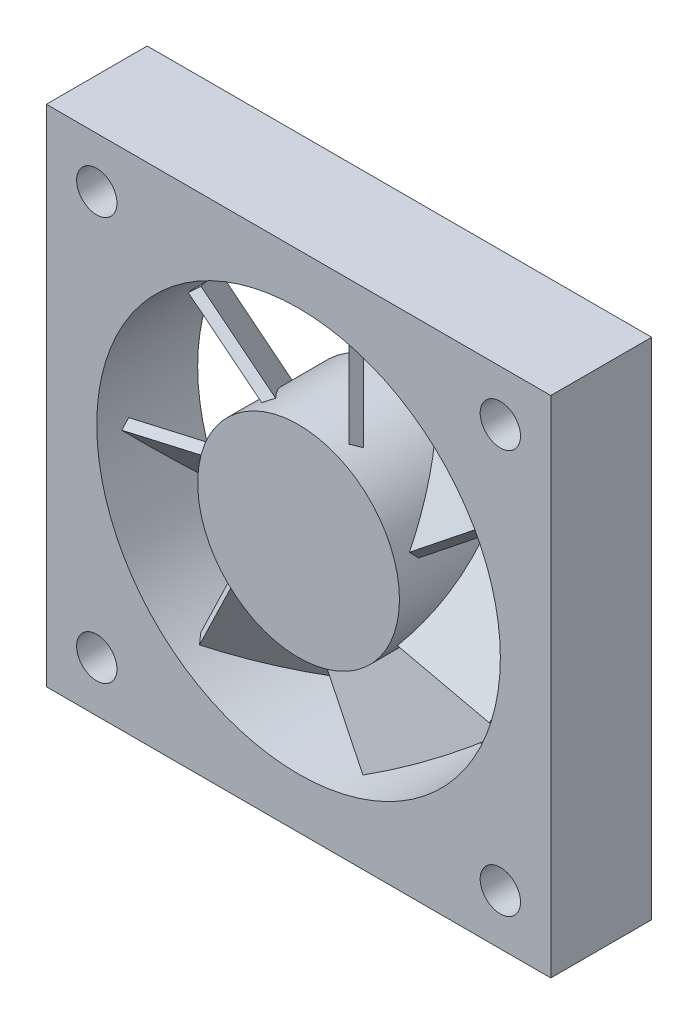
ISO-10303-21;
HEADER;
FILE_DESCRIPTION(('STEP AP214'),'2;1');
FILE_NAME('part.step','',(''),(''),'','','');
FILE_SCHEMA(('AUTOMOTIVE_DESIGN { 1 0 10303 214 1 1 1 1 }'));
ENDSEC;
DATA;
#1=APPLICATION_CONTEXT('core data for automotive mechanical design processes');
#2=APPLICATION_PROTOCOL_DEFINITION('international standard','automotive_design',2000,#1);
#3=PRODUCT_CONTEXT('',#1,'mechanical');
#4=PRODUCT('Part','Part','',(#3));
#5=PRODUCT_RELATED_PRODUCT_CATEGORY('part','',(#4));
#6=PRODUCT_DEFINITION_FORMATION('','',#4);
#7=PRODUCT_DEFINITION_CONTEXT('part definition',#1,'design');
#8=PRODUCT_DEFINITION('design','',#6,#7);
#9=PRODUCT_DEFINITION_SHAPE('','',#8);
#10=(LENGTH_UNIT() NAMED_UNIT(*) SI_UNIT(.MILLI.,.METRE.));
#11=(NAMED_UNIT(*) PLANE_ANGLE_UNIT() SI_UNIT($,.RADIAN.));
#12=(NAMED_UNIT(*) SI_UNIT($,.STERADIAN.) SOLID_ANGLE_UNIT());
#13=UNCERTAINTY_MEASURE_WITH_UNIT(LENGTH_MEASURE(1.E-05),#10,'distance_accuracy_value','');
#14=(GEOMETRIC_REPRESENTATION_CONTEXT(3) GLOBAL_UNCERTAINTY_ASSIGNED_CONTEXT((#13)) GLOBAL_UNIT_ASSIGNED_CONTEXT((#10,
#11,#12)) REPRESENTATION_CONTEXT('',''));
#15=CARTESIAN_POINT('',(0.,0.,0.));
#16=DIRECTION('',(0.,0.,1.));
#17=DIRECTION('',(1.,0.,0.));
#18=AXIS2_PLACEMENT_3D('',#15,#16,#17);
#19=CARTESIAN_POINT('',(0.,0.,10.));
#20=DIRECTION('',(0.,0.,-1.));
#21=DIRECTION('',(-1.,0.,0.));
#22=AXIS2_PLACEMENT_3D('',#19,#20,#21);
#23=CYLINDRICAL_SURFACE('',#22,10.);
#24=CARTESIAN_POINT('',(0.,0.,3.58578643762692));
#25=DIRECTION('',(0.157346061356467,0.689378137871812,0.707106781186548));
#26=DIRECTION('',(0.157346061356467,0.689378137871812,-0.707106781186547));
#27=AXIS2_PLACEMENT_3D('',#24,#25,#26);
#28=ELLIPSE('',#27,14.1421356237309,10.);
#29=CARTESIAN_POINT('',(7.88427135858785,-6.15128158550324,7.8284271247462));
#30=VERTEX_POINT('',#29);
#31=CARTESIAN_POINT('',(9.98056427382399,0.623166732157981,0.757359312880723));
#32=VERTEX_POINT('',#31);
#33=EDGE_CURVE('E305',#30,#32,#28,.T.);
#34=ORIENTED_EDGE('',*,*,#33,.F.);
#35=CARTESIAN_POINT('',(0.,0.,12.0710678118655));
#36=DIRECTION('',(0.157346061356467,0.689378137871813,-0.707106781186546));
#37=DIRECTION('',(-0.157346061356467,-0.689378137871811,-0.707106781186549));
#38=AXIS2_PLACEMENT_3D('',#35,#36,#37);
#39=ELLIPSE('',#38,14.142135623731,10.);
#40=CARTESIAN_POINT('',(8.33288525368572,-5.52838342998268,8.53553390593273));
#41=VERTEX_POINT('',#40);
#42=EDGE_CURVE('E299',#41,#30,#39,.T.);
#43=ORIENTED_EDGE('',*,*,#42,.F.);
#44=CARTESIAN_POINT('',(0.,0.,5.));
#45=DIRECTION('',(-0.157346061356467,-0.68937813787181,-0.707106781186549));
#46=DIRECTION('',(0.157346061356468,0.689378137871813,-0.707106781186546));
#47=AXIS2_PLACEMENT_3D('',#44,#45,#46);
#48=ELLIPSE('',#47,14.1421356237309,10.);
#49=CARTESIAN_POINT('',(9.9063458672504,1.36539794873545,1.46446609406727));
#50=VERTEX_POINT('',#49);
#51=EDGE_CURVE('E293',#50,#41,#48,.T.);
#52=ORIENTED_EDGE('',*,*,#51,.F.);
#53=CARTESIAN_POINT('',(0.,0.,-2.07106781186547));
#54=DIRECTION('',(-0.157346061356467,-0.689378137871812,0.707106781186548));
#55=DIRECTION('',(-0.157346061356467,-0.689378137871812,-0.707106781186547));
#56=AXIS2_PLACEMENT_3D('',#53,#54,#55);
#57=ELLIPSE('',#56,14.1421356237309,10.);
#58=EDGE_CURVE('E273',#32,#50,#57,.T.);
#59=ORIENTED_EDGE('',*,*,#58,.F.);
#60=EDGE_LOOP('',(#34,#43,#52,#59));
#61=FACE_BOUND('',#60,.T.);
#62=CARTESIAN_POINT('',(0.,0.,3.58578643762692));
#63=DIRECTION('',(0.637081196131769,-0.306802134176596,0.707106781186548));
#64=DIRECTION('',(0.637081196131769,-0.306802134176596,-0.707106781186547));
#65=AXIS2_PLACEMENT_3D('',#62,#63,#64);
#66=ELLIPSE('',#65,14.1421356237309,10.);
#67=CARTESIAN_POINT('',(-7.75147153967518,-6.31780729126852,7.8284271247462));
#68=VERTEX_POINT('',#67);
#69=CARTESIAN_POINT('',(-1.61334184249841,-9.868998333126,0.757359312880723));
#70=VERTEX_POINT('',#69);
#71=EDGE_CURVE('E375',#68,#70,#66,.T.);
#72=ORIENTED_EDGE('',*,*,#71,.F.);
#73=CARTESIAN_POINT('',(0.,0.,12.0710678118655));
#74=DIRECTION('',(0.63708119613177,-0.306802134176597,-0.707106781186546));
#75=DIRECTION('',(-0.637081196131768,0.306802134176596,-0.707106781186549));
#76=AXIS2_PLACEMENT_3D('',#73,#74,#75);
#77=ELLIPSE('',#76,14.142135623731,10.);
#78=CARTESIAN_POINT('',(-7.24401672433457,-6.89378137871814,8.53553390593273));
#79=VERTEX_POINT('',#78);
#80=EDGE_CURVE('E369',#79,#68,#77,.T.);
#81=ORIENTED_EDGE('',*,*,#80,.F.);
#82=CARTESIAN_POINT('',(0.,0.,5.));
#83=DIRECTION('',(-0.637081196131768,0.306802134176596,-0.707106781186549));
#84=DIRECTION('',(0.637081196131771,-0.306802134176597,-0.707106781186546));
#85=AXIS2_PLACEMENT_3D('',#82,#83,#84);
#86=ELLIPSE('',#85,14.1421356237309,10.);
#87=CARTESIAN_POINT('',(-0.87320476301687,-9.96180272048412,1.46446609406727));
#88=VERTEX_POINT('',#87);
#89=EDGE_CURVE('E363',#88,#79,#86,.T.);
#90=ORIENTED_EDGE('',*,*,#89,.F.);
#91=CARTESIAN_POINT('',(0.,0.,-2.07106781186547));
#92=DIRECTION('',(-0.637081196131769,0.306802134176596,0.707106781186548));
#93=DIRECTION('',(-0.63708119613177,0.306802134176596,-0.707106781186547));
#94=AXIS2_PLACEMENT_3D('',#91,#92,#93);
#95=ELLIPSE('',#94,14.1421356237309,10.);
#96=EDGE_CURVE('E343',#70,#88,#95,.T.);
#97=ORIENTED_EDGE('',*,*,#96,.F.);
#98=EDGE_LOOP('',(#72,#81,#90,#97));
#99=FACE_BOUND('',#98,.T.);
#100=CARTESIAN_POINT('',(0.,0.,3.58578643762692));
#101=DIRECTION('',(-0.440873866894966,-0.552838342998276,0.707106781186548));
#102=DIRECTION('',(-0.440873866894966,-0.552838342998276,-0.707106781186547));
#103=AXIS2_PLACEMENT_3D('',#100,#101,#102);
#104=ELLIPSE('',#103,14.1421356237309,10.);
#105=CARTESIAN_POINT('',(-4.43454198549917,8.96297034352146,7.8284271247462));
#106=VERTEX_POINT('',#105);
#107=CARTESIAN_POINT('',(-9.26255960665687,3.76895072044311,0.757359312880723));
#108=VERTEX_POINT('',#107);
#109=EDGE_CURVE('E445',#106,#108,#104,.T.);
#110=ORIENTED_EDGE('',*,*,#109,.F.);
#111=CARTESIAN_POINT('',(0.,0.,12.0710678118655));
#112=DIRECTION('',(-0.440873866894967,-0.552838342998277,-0.707106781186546));
#113=DIRECTION('',(0.440873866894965,0.552838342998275,-0.707106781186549));
#114=AXIS2_PLACEMENT_3D('',#111,#112,#113);
#115=ELLIPSE('',#114,14.142135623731,10.);
#116=CARTESIAN_POINT('',(-5.10899451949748,8.59640477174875,8.53553390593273));
#117=VERTEX_POINT('',#116);
#118=EDGE_CURVE('E439',#117,#106,#115,.T.);
#119=ORIENTED_EDGE('',*,*,#118,.F.);
#120=CARTESIAN_POINT('',(0.,0.,5.));
#121=DIRECTION('',(0.440873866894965,0.552838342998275,-0.707106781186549));
#122=DIRECTION('',(-0.440873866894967,-0.552838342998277,-0.707106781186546));
#123=AXIS2_PLACEMENT_3D('',#120,#121,#122);
#124=ELLIPSE('',#123,14.1421356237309,10.);
#125=CARTESIAN_POINT('',(-9.51773318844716,3.06802134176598,1.46446609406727));
#126=VERTEX_POINT('',#125);
#127=EDGE_CURVE('E433',#126,#117,#124,.T.);
#128=ORIENTED_EDGE('',*,*,#127,.F.);
#129=CARTESIAN_POINT('',(0.,0.,-2.07106781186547));
#130=DIRECTION('',(0.440873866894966,0.552838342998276,0.707106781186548));
#131=DIRECTION('',(0.440873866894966,0.552838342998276,-0.707106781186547));
#132=AXIS2_PLACEMENT_3D('',#129,#130,#131);
#133=ELLIPSE('',#132,14.1421356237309,10.);
#134=EDGE_CURVE('E413',#108,#126,#133,.T.);
#135=ORIENTED_EDGE('',*,*,#134,.F.);
#136=EDGE_LOOP('',(#110,#119,#128,#135));
#137=FACE_BOUND('',#136,.T.);
#138=CARTESIAN_POINT('',(0.,0.,0.));
#139=DIRECTION('',(0.,0.,1.));
#140=DIRECTION('',(1.,0.,0.));
#141=AXIS2_PLACEMENT_3D('',#138,#139,#140);
#142=CIRCLE('',#141,10.);
#143=CARTESIAN_POINT('',(10.,0.,0.));
#144=VERTEX_POINT('',#143);
#145=EDGE_CURVE('E459',#144,#144,#142,.T.);
#146=ORIENTED_EDGE('',*,*,#145,.T.);
#147=EDGE_LOOP('',(#146));
#148=FACE_BOUND('',#147,.T.);
#149=CARTESIAN_POINT('',(0.,0.,10.));
#150=DIRECTION('',(0.,0.,1.));
#151=DIRECTION('',(1.,0.,0.));
#152=AXIS2_PLACEMENT_3D('',#149,#150,#151);
#153=CIRCLE('',#152,10.);
#154=CARTESIAN_POINT('',(10.,0.,10.));
#155=VERTEX_POINT('',#154);
#156=EDGE_CURVE('E473',#155,#155,#153,.T.);
#157=ORIENTED_EDGE('',*,*,#156,.F.);
#158=EDGE_LOOP('',(#157));
#159=FACE_BOUND('',#158,.T.);
#160=CARTESIAN_POINT('',(0.,0.,3.58578643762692));
#161=DIRECTION('',(-0.707106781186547,0.,0.707106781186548));
#162=DIRECTION('',(-0.707106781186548,0.,-0.707106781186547));
#163=AXIS2_PLACEMENT_3D('',#160,#161,#162);
#164=ELLIPSE('',#163,14.1421356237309,10.);
#165=CARTESIAN_POINT('',(4.24264068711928,9.05538513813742,7.8284271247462));
#166=VERTEX_POINT('',#165);
#167=CARTESIAN_POINT('',(-2.8284271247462,9.59166304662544,0.757359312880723));
#168=VERTEX_POINT('',#167);
#169=EDGE_CURVE('E14',#166,#168,#164,.T.);
#170=ORIENTED_EDGE('',*,*,#169,.F.);
#171=CARTESIAN_POINT('',(0.,0.,12.0710678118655));
#172=DIRECTION('',(-0.707106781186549,0.,-0.707106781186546));
#173=DIRECTION('',(0.707106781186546,0.,-0.707106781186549));
#174=AXIS2_PLACEMENT_3D('',#171,#172,#173);
#175=ELLIPSE('',#174,14.142135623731,10.);
#176=CARTESIAN_POINT('',(3.53553390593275,9.35414346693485,8.53553390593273));
#177=VERTEX_POINT('',#176);
#178=EDGE_CURVE('E67',#177,#166,#175,.T.);
#179=ORIENTED_EDGE('',*,*,#178,.F.);
#180=CARTESIAN_POINT('',(0.,0.,5.));
#181=DIRECTION('',(0.707106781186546,0.,-0.707106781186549));
#182=DIRECTION('',(-0.707106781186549,0.,-0.707106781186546));
#183=AXIS2_PLACEMENT_3D('',#180,#181,#182);
#184=ELLIPSE('',#183,14.1421356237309,10.);
#185=CARTESIAN_POINT('',(-3.53553390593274,9.35414346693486,1.46446609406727));
#186=VERTEX_POINT('',#185);
#187=EDGE_CURVE('E481',#186,#177,#184,.T.);
#188=ORIENTED_EDGE('',*,*,#187,.F.);
#189=CARTESIAN_POINT('',(0.,0.,-2.07106781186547));
#190=DIRECTION('',(0.707106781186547,0.,0.707106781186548));
#191=DIRECTION('',(0.707106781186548,0.,-0.707106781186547));
#192=AXIS2_PLACEMENT_3D('',#189,#190,#191);
#193=ELLIPSE('',#192,14.1421356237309,10.);
#194=EDGE_CURVE('E476',#168,#186,#193,.T.);
#195=ORIENTED_EDGE('',*,*,#194,.F.);
#196=EDGE_LOOP('',(#170,#179,#188,#195));
#197=FACE_BOUND('',#196,.T.);
#198=CARTESIAN_POINT('',(0.,0.,3.58578643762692));
#199=DIRECTION('',(0.157346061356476,-0.689378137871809,0.707106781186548));
#200=DIRECTION('',(0.157346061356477,-0.68937813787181,-0.707106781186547));
#201=AXIS2_PLACEMENT_3D('',#198,#199,#200);
#202=ELLIPSE('',#201,14.1421356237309,10.);
#203=CARTESIAN_POINT('',(-9.77242409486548,2.12125606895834,7.8284271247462));
#204=VERTEX_POINT('',#203);
#205=CARTESIAN_POINT('',(-8.72179578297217,-4.89185837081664,0.757359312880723));
#206=VERTEX_POINT('',#205);
#207=EDGE_CURVE('E410',#204,#206,#202,.T.);
#208=ORIENTED_EDGE('',*,*,#207,.F.);
#209=CARTESIAN_POINT('',(0.,0.,12.0710678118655));
#210=DIRECTION('',(0.157346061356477,-0.689378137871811,-0.707106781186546));
#211=DIRECTION('',(-0.157346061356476,0.689378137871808,-0.707106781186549));
#212=AXIS2_PLACEMENT_3D('',#209,#210,#211);
#213=ELLIPSE('',#212,14.142135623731,10.);
#214=CARTESIAN_POINT('',(-9.90634586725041,1.36539794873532,8.53553390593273));
#215=VERTEX_POINT('',#214);
#216=EDGE_CURVE('E404',#215,#204,#213,.T.);
#217=ORIENTED_EDGE('',*,*,#216,.F.);
#218=CARTESIAN_POINT('',(0.,0.,5.));
#219=DIRECTION('',(-0.157346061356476,0.689378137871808,-0.707106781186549));
#220=DIRECTION('',(0.157346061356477,-0.689378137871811,-0.707106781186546));
#221=AXIS2_PLACEMENT_3D('',#218,#219,#220);
#222=ELLIPSE('',#221,14.1421356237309,10.);
#223=CARTESIAN_POINT('',(-8.33288525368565,-5.52838342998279,1.46446609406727));
#224=VERTEX_POINT('',#223);
#225=EDGE_CURVE('E398',#224,#215,#222,.T.);
#226=ORIENTED_EDGE('',*,*,#225,.F.);
#227=CARTESIAN_POINT('',(0.,0.,-2.07106781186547));
#228=DIRECTION('',(-0.157346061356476,0.68937813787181,0.707106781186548));
#229=DIRECTION('',(-0.157346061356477,0.68937813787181,-0.707106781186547));
#230=AXIS2_PLACEMENT_3D('',#227,#228,#229);
#231=ELLIPSE('',#230,14.1421356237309,10.);
#232=EDGE_CURVE('E378',#206,#224,#231,.T.);
#233=ORIENTED_EDGE('',*,*,#232,.F.);
#234=EDGE_LOOP('',(#208,#217,#226,#233));
#235=FACE_BOUND('',#234,.T.);
#236=CARTESIAN_POINT('',(0.,0.,3.58578643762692));
#237=DIRECTION('',(0.637081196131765,0.306802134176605,0.707106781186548));
#238=DIRECTION('',(0.637081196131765,0.306802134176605,-0.707106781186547));
#239=AXIS2_PLACEMENT_3D('',#236,#237,#238);
#240=ELLIPSE('',#239,14.1421356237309,10.);
#241=CARTESIAN_POINT('',(0.106497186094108,-9.99943290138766,7.8284271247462));
#242=VERTEX_POINT('',#241);
#243=CARTESIAN_POINT('',(6.70999141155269,-7.41458125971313,0.757359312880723));
#244=VERTEX_POINT('',#243);
#245=EDGE_CURVE('E340',#242,#244,#240,.T.);
#246=ORIENTED_EDGE('',*,*,#245,.F.);
#247=CARTESIAN_POINT('',(0.,0.,12.0710678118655));
#248=DIRECTION('',(0.637081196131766,0.306802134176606,-0.707106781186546));
#249=DIRECTION('',(-0.637081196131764,-0.306802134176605,-0.707106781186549));
#250=AXIS2_PLACEMENT_3D('',#247,#248,#249);
#251=ELLIPSE('',#250,14.142135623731,10.);
#252=CARTESIAN_POINT('',(0.873204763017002,-9.9618027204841,8.53553390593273));
#253=VERTEX_POINT('',#252);
#254=EDGE_CURVE('E334',#253,#242,#251,.T.);
#255=ORIENTED_EDGE('',*,*,#254,.F.);
#256=CARTESIAN_POINT('',(0.,0.,5.));
#257=DIRECTION('',(-0.637081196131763,-0.306802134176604,-0.707106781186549));
#258=DIRECTION('',(0.637081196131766,0.306802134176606,-0.707106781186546));
#259=AXIS2_PLACEMENT_3D('',#256,#257,#258);
#260=ELLIPSE('',#259,14.1421356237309,10.);
#261=CARTESIAN_POINT('',(7.24401672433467,-6.89378137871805,1.46446609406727));
#262=VERTEX_POINT('',#261);
#263=EDGE_CURVE('E328',#262,#253,#260,.T.);
#264=ORIENTED_EDGE('',*,*,#263,.F.);
#265=CARTESIAN_POINT('',(0.,0.,-2.07106781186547));
#266=DIRECTION('',(-0.637081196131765,-0.306802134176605,0.707106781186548));
#267=DIRECTION('',(-0.637081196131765,-0.306802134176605,-0.707106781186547));
#268=AXIS2_PLACEMENT_3D('',#265,#266,#267);
#269=ELLIPSE('',#268,14.1421356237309,10.);
#270=EDGE_CURVE('E308',#244,#262,#269,.T.);
#271=ORIENTED_EDGE('',*,*,#270,.F.);
#272=EDGE_LOOP('',(#246,#255,#264,#271));
#273=FACE_BOUND('',#272,.T.);
#274=CARTESIAN_POINT('',(0.,0.,3.58578643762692));
#275=DIRECTION('',(-0.440873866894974,0.55283834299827,0.707106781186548));
#276=DIRECTION('',(-0.440873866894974,0.55283834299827,-0.707106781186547));
#277=AXIS2_PLACEMENT_3D('',#274,#275,#276);
#278=ELLIPSE('',#277,14.1421356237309,10.);
#279=CARTESIAN_POINT('',(9.72502838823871,2.3289102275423,7.8284271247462));
#280=VERTEX_POINT('',#279);
#281=CARTESIAN_POINT('',(5.73556867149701,8.19165746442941,0.757359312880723));
#282=VERTEX_POINT('',#281);
#283=EDGE_CURVE('E74',#280,#282,#278,.T.);
#284=ORIENTED_EDGE('',*,*,#283,.F.);
#285=CARTESIAN_POINT('',(0.,0.,12.0710678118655));
#286=DIRECTION('',(-0.440873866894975,0.552838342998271,-0.707106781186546));
#287=DIRECTION('',(0.440873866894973,-0.552838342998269,-0.707106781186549));
#288=AXIS2_PLACEMENT_3D('',#285,#286,#287);
#289=ELLIPSE('',#288,14.142135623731,10.);
#290=CARTESIAN_POINT('',(9.51773318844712,3.06802134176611,8.53553390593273));
#291=VERTEX_POINT('',#290);
#292=EDGE_CURVE('E78',#291,#280,#289,.T.);
#293=ORIENTED_EDGE('',*,*,#292,.F.);
#294=CARTESIAN_POINT('',(0.,0.,5.));
#295=DIRECTION('',(0.440873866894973,-0.552838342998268,-0.707106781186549));
#296=DIRECTION('',(-0.440873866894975,0.552838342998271,-0.707106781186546));
#297=AXIS2_PLACEMENT_3D('',#294,#295,#296);
#298=ELLIPSE('',#297,14.1421356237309,10.);
#299=CARTESIAN_POINT('',(5.10899451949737,8.59640477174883,1.46446609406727));
#300=VERTEX_POINT('',#299);
#301=EDGE_CURVE('E264',#300,#291,#298,.T.);
#302=ORIENTED_EDGE('',*,*,#301,.F.);
#303=CARTESIAN_POINT('',(0.,0.,-2.07106781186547));
#304=DIRECTION('',(0.440873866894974,-0.55283834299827,0.707106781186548));
#305=DIRECTION('',(0.440873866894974,-0.55283834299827,-0.707106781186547));
#306=AXIS2_PLACEMENT_3D('',#303,#304,#305);
#307=ELLIPSE('',#306,14.1421356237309,10.);
#308=EDGE_CURVE('E252',#282,#300,#307,.T.);
#309=ORIENTED_EDGE('',*,*,#308,.F.);
#310=EDGE_LOOP('',(#284,#293,#302,#309));
#311=FACE_BOUND('',#310,.T.);
#312=ADVANCED_FACE('F60',(#61,#99,#137,#148,#159,#197,#235,#273,#311),#23,.T.);
#313=CARTESIAN_POINT('',(0.,0.,10.));
#314=DIRECTION('',(0.,0.,1.));
#315=DIRECTION('',(1.,0.,0.));
#316=AXIS2_PLACEMENT_3D('',#313,#314,#315);
#317=PLANE('',#316);
#318=ORIENTED_EDGE('',*,*,#156,.T.);
#319=EDGE_LOOP('',(#318));
#320=FACE_BOUND('',#319,.T.);
#321=ADVANCED_FACE('F501',(#320),#317,.T.);
#322=CARTESIAN_POINT('',(0.,0.,0.));
#323=DIRECTION('',(0.,0.,1.));
#324=DIRECTION('',(1.,0.,0.));
#325=AXIS2_PLACEMENT_3D('',#322,#323,#324);
#326=PLANE('',#325);
#327=ORIENTED_EDGE('',*,*,#145,.F.);
#328=EDGE_LOOP('',(#327));
#329=FACE_BOUND('',#328,.T.);
#330=ADVANCED_FACE('F595',(#329),#326,.F.);
#331=CARTESIAN_POINT('',(4.24264068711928,27.001,7.8284271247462));
#332=DIRECTION('',(-0.707106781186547,0.,0.707106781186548));
#333=DIRECTION('',(0.707106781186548,0.,0.707106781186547));
#334=AXIS2_PLACEMENT_3D('',#331,#332,#333);
#335=PLANE('',#334);
#336=DIRECTION('',(0.,-1.,0.));
#337=VECTOR('',#336,1.);
#338=CARTESIAN_POINT('',(4.24264068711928,27.001,7.8284271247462));
#339=LINE('',#338,#337);
#340=CARTESIAN_POINT('',(4.24264068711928,18.5202591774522,7.8284271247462));
#341=VERTEX_POINT('',#340);
#342=EDGE_CURVE('E462',#341,#166,#339,.T.);
#343=ORIENTED_EDGE('',*,*,#342,.T.);
#344=ORIENTED_EDGE('',*,*,#169,.T.);
#345=DIRECTION('',(0.,-1.,0.));
#346=VECTOR('',#345,1.);
#347=CARTESIAN_POINT('',(-2.8284271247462,27.001,0.757359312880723));
#348=LINE('',#347,#346);
#349=CARTESIAN_POINT('',(-2.8284271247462,18.788294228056,0.757359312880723));
#350=VERTEX_POINT('',#349);
#351=EDGE_CURVE('E448',#350,#168,#348,.T.);
#352=ORIENTED_EDGE('',*,*,#351,.F.);
#353=CARTESIAN_POINT('',(0.,0.,3.58578643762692));
#354=DIRECTION('',(-0.707106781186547,0.,0.707106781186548));
#355=DIRECTION('',(-0.707106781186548,0.,-0.707106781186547));
#356=AXIS2_PLACEMENT_3D('',#353,#354,#355);
#357=ELLIPSE('',#356,26.8700576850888,19.);
#358=EDGE_CURVE('E453',#350,#341,#357,.F.);
#359=ORIENTED_EDGE('',*,*,#358,.T.);
#360=EDGE_LOOP('',(#343,#344,#352,#359));
#361=FACE_BOUND('',#360,.T.);
#362=ADVANCED_FACE('F490',(#361),#335,.F.);
#363=CARTESIAN_POINT('',(3.53553390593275,27.001,8.53553390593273));
#364=DIRECTION('',(-0.707106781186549,0.,-0.707106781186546));
#365=DIRECTION('',(-0.707106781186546,0.,0.707106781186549));
#366=AXIS2_PLACEMENT_3D('',#363,#364,#365);
#367=PLANE('',#366);
#368=DIRECTION('',(0.,-1.,0.));
#369=VECTOR('',#368,1.);
#370=CARTESIAN_POINT('',(3.53553390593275,27.001,8.53553390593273));
#371=LINE('',#370,#369);
#372=CARTESIAN_POINT('',(3.53553390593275,18.6681547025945,8.53553390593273));
#373=VERTEX_POINT('',#372);
#374=EDGE_CURVE('E465',#373,#177,#371,.T.);
#375=ORIENTED_EDGE('',*,*,#374,.T.);
#376=ORIENTED_EDGE('',*,*,#178,.T.);
#377=ORIENTED_EDGE('',*,*,#342,.F.);
#378=CARTESIAN_POINT('',(0.,0.,12.0710678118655));
#379=DIRECTION('',(-0.707106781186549,0.,-0.707106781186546));
#380=DIRECTION('',(0.707106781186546,0.,-0.707106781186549));
#381=AXIS2_PLACEMENT_3D('',#378,#379,#380);
#382=ELLIPSE('',#381,26.8700576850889,19.);
#383=EDGE_CURVE('E449',#341,#373,#382,.F.);
#384=ORIENTED_EDGE('',*,*,#383,.T.);
#385=EDGE_LOOP('',(#375,#376,#377,#384));
#386=FACE_BOUND('',#385,.T.);
#387=ADVANCED_FACE('F486',(#386),#367,.F.);
#388=CARTESIAN_POINT('',(-3.53553390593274,27.001,1.46446609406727));
#389=DIRECTION('',(0.707106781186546,0.,-0.707106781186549));
#390=DIRECTION('',(-0.707106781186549,0.,-0.707106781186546));
#391=AXIS2_PLACEMENT_3D('',#388,#389,#390);
#392=PLANE('',#391);
#393=DIRECTION('',(0.,-1.,0.));
#394=VECTOR('',#393,1.);
#395=CARTESIAN_POINT('',(-3.53553390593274,27.001,1.46446609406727));
#396=LINE('',#395,#394);
#397=CARTESIAN_POINT('',(-3.53553390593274,18.6681547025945,1.46446609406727));
#398=VERTEX_POINT('',#397);
#399=EDGE_CURVE('E468',#398,#186,#396,.T.);
#400=ORIENTED_EDGE('',*,*,#399,.T.);
#401=ORIENTED_EDGE('',*,*,#187,.T.);
#402=ORIENTED_EDGE('',*,*,#374,.F.);
#403=CARTESIAN_POINT('',(0.,0.,5.));
#404=DIRECTION('',(0.707106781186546,0.,-0.707106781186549));
#405=DIRECTION('',(-0.707106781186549,0.,-0.707106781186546));
#406=AXIS2_PLACEMENT_3D('',#403,#404,#405);
#407=ELLIPSE('',#406,26.8700576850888,19.);
#408=EDGE_CURVE('E452',#373,#398,#407,.F.);
#409=ORIENTED_EDGE('',*,*,#408,.T.);
#410=EDGE_LOOP('',(#400,#401,#402,#409));
#411=FACE_BOUND('',#410,.T.);
#412=ADVANCED_FACE('F498',(#411),#392,.F.);
#413=CARTESIAN_POINT('',(-2.8284271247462,27.001,0.757359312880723));
#414=DIRECTION('',(0.707106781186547,0.,0.707106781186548));
#415=DIRECTION('',(0.707106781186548,0.,-0.707106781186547));
#416=AXIS2_PLACEMENT_3D('',#413,#414,#415);
#417=PLANE('',#416);
#418=ORIENTED_EDGE('',*,*,#351,.T.);
#419=ORIENTED_EDGE('',*,*,#194,.T.);
#420=ORIENTED_EDGE('',*,*,#399,.F.);
#421=CARTESIAN_POINT('',(0.,0.,-2.07106781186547));
#422=DIRECTION('',(0.707106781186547,0.,0.707106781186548));
#423=DIRECTION('',(0.707106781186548,0.,-0.707106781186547));
#424=AXIS2_PLACEMENT_3D('',#421,#422,#423);
#425=ELLIPSE('',#424,26.8700576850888,19.);
#426=EDGE_CURVE('E456',#398,#350,#425,.F.);
#427=ORIENTED_EDGE('',*,*,#426,.T.);
#428=EDGE_LOOP('',(#418,#419,#420,#427));
#429=FACE_BOUND('',#428,.T.);
#430=ADVANCED_FACE('F496',(#429),#417,.F.);
#431=CARTESIAN_POINT('',(0.,0.,10.));
#432=DIRECTION('',(0.,0.,-1.));
#433=DIRECTION('',(-1.,0.,0.));
#434=AXIS2_PLACEMENT_3D('',#431,#432,#433);
#435=CYLINDRICAL_SURFACE('',#434,19.);
#436=ORIENTED_EDGE('',*,*,#408,.F.);
#437=ORIENTED_EDGE('',*,*,#383,.F.);
#438=ORIENTED_EDGE('',*,*,#358,.F.);
#439=ORIENTED_EDGE('',*,*,#426,.F.);
#440=EDGE_LOOP('',(#436,#437,#438,#439));
#441=FACE_BOUND('',#440,.T.);
#442=ADVANCED_FACE('F493',(#441),#435,.T.);
#443=CARTESIAN_POINT('',(-18.4649886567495,20.1518781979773,7.8284271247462));
#444=DIRECTION('',(-0.440873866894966,-0.552838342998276,0.707106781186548));
#445=DIRECTION('',(0.440873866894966,0.552838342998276,0.707106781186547));
#446=AXIS2_PLACEMENT_3D('',#443,#444,#445);
#447=PLANE('',#446);
#448=DIRECTION('',(0.781831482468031,-0.623489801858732,0.));
#449=VECTOR('',#448,1.);
#450=CARTESIAN_POINT('',(-18.4649886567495,20.1518781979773,7.8284271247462));
#451=LINE('',#450,#449);
#452=CARTESIAN_POINT('',(-11.8344784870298,14.8642227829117,7.8284271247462));
#453=VERTEX_POINT('',#452);
#454=EDGE_CURVE('E442',#453,#106,#451,.T.);
#455=ORIENTED_EDGE('',*,*,#454,.T.);
#456=ORIENTED_EDGE('',*,*,#109,.T.);
#457=DIRECTION('',(0.781831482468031,-0.623489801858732,0.));
#458=VECTOR('',#457,1.);
#459=CARTESIAN_POINT('',(-22.8737273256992,14.6234947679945,0.757359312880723));
#460=LINE('',#459,#458);
#461=CARTESIAN_POINT('',(-16.4527753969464,9.50295647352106,0.757359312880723));
#462=VERTEX_POINT('',#461);
#463=EDGE_CURVE('E427',#462,#108,#460,.T.);
#464=ORIENTED_EDGE('',*,*,#463,.F.);
#465=CARTESIAN_POINT('',(0.,0.,3.58578643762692));
#466=DIRECTION('',(-0.440873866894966,-0.552838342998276,0.707106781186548));
#467=DIRECTION('',(-0.440873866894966,-0.552838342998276,-0.707106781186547));
#468=AXIS2_PLACEMENT_3D('',#465,#466,#467);
#469=ELLIPSE('',#468,26.8700576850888,19.);
#470=EDGE_CURVE('E421',#462,#453,#469,.F.);
#471=ORIENTED_EDGE('',*,*,#470,.T.);
#472=EDGE_LOOP('',(#455,#456,#464,#471));
#473=FACE_BOUND('',#472,.T.);
#474=ADVANCED_FACE('F586',(#473),#447,.F.);
#475=CARTESIAN_POINT('',(-18.9058625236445,19.599039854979,8.53553390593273));
#476=DIRECTION('',(-0.440873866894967,-0.552838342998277,-0.707106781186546));
#477=DIRECTION('',(-0.440873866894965,-0.552838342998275,0.707106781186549));
#478=AXIS2_PLACEMENT_3D('',#475,#476,#477);
#479=PLANE('',#478);
#480=DIRECTION('',(0.781831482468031,-0.623489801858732,0.));
#481=VECTOR('',#480,1.);
#482=CARTESIAN_POINT('',(-18.9058625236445,19.599039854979,8.53553390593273));
#483=LINE('',#482,#481);
#484=CARTESIAN_POINT('',(-12.3909817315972,14.4035957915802,8.53553390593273));
#485=VERTEX_POINT('',#484);
#486=EDGE_CURVE('E436',#485,#117,#483,.T.);
#487=ORIENTED_EDGE('',*,*,#486,.T.);
#488=ORIENTED_EDGE('',*,*,#118,.T.);
#489=ORIENTED_EDGE('',*,*,#454,.F.);
#490=CARTESIAN_POINT('',(0.,0.,12.0710678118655));
#491=DIRECTION('',(-0.440873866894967,-0.552838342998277,-0.707106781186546));
#492=DIRECTION('',(0.440873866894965,0.552838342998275,-0.707106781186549));
#493=AXIS2_PLACEMENT_3D('',#490,#491,#492);
#494=ELLIPSE('',#493,26.8700576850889,19.);
#495=EDGE_CURVE('E418',#453,#485,#494,.F.);
#496=ORIENTED_EDGE('',*,*,#495,.T.);
#497=EDGE_LOOP('',(#487,#488,#489,#496));
#498=FACE_BOUND('',#497,.T.);
#499=ADVANCED_FACE('F582',(#498),#479,.F.);
#500=CARTESIAN_POINT('',(-23.3146011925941,14.0706564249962,1.46446609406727));
#501=DIRECTION('',(0.440873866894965,0.552838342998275,-0.707106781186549));
#502=DIRECTION('',(-0.440873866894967,-0.552838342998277,-0.707106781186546));
#503=AXIS2_PLACEMENT_3D('',#500,#501,#502);
#504=PLANE('',#503);
#505=DIRECTION('',(0.781831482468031,-0.623489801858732,0.));
#506=VECTOR('',#505,1.);
#507=CARTESIAN_POINT('',(-23.3146011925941,14.0706564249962,1.46446609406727));
#508=LINE('',#507,#506);
#509=CARTESIAN_POINT('',(-16.7997204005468,8.87521236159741,1.46446609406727));
#510=VERTEX_POINT('',#509);
#511=EDGE_CURVE('E430',#510,#126,#508,.T.);
#512=ORIENTED_EDGE('',*,*,#511,.T.);
#513=ORIENTED_EDGE('',*,*,#127,.T.);
#514=ORIENTED_EDGE('',*,*,#486,.F.);
#515=CARTESIAN_POINT('',(0.,0.,5.));
#516=DIRECTION('',(0.440873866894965,0.552838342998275,-0.707106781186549));
#517=DIRECTION('',(-0.440873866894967,-0.552838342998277,-0.707106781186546));
#518=AXIS2_PLACEMENT_3D('',#515,#516,#517);
#519=ELLIPSE('',#518,26.8700576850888,19.);
#520=EDGE_CURVE('E416',#485,#510,#519,.F.);
#521=ORIENTED_EDGE('',*,*,#520,.T.);
#522=EDGE_LOOP('',(#512,#513,#514,#521));
#523=FACE_BOUND('',#522,.T.);
#524=ADVANCED_FACE('F578',(#523),#504,.F.);
#525=CARTESIAN_POINT('',(-22.8737273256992,14.6234947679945,0.757359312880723));
#526=DIRECTION('',(0.440873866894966,0.552838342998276,0.707106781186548));
#527=DIRECTION('',(0.440873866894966,0.552838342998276,-0.707106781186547));
#528=AXIS2_PLACEMENT_3D('',#525,#526,#527);
#529=PLANE('',#528);
#530=ORIENTED_EDGE('',*,*,#463,.T.);
#531=ORIENTED_EDGE('',*,*,#134,.T.);
#532=ORIENTED_EDGE('',*,*,#511,.F.);
#533=CARTESIAN_POINT('',(0.,0.,-2.07106781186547));
#534=DIRECTION('',(0.440873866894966,0.552838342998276,0.707106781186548));
#535=DIRECTION('',(0.440873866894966,0.552838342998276,-0.707106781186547));
#536=AXIS2_PLACEMENT_3D('',#533,#534,#535);
#537=ELLIPSE('',#536,26.8700576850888,19.);
#538=EDGE_CURVE('E424',#510,#462,#537,.F.);
#539=ORIENTED_EDGE('',*,*,#538,.T.);
#540=EDGE_LOOP('',(#530,#531,#532,#539));
#541=FACE_BOUND('',#540,.T.);
#542=ADVANCED_FACE('F574',(#541),#529,.F.);
#543=CARTESIAN_POINT('',(0.,0.,10.));
#544=DIRECTION('',(0.,0.,-1.));
#545=DIRECTION('',(-0.623489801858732,-0.781831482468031,0.));
#546=AXIS2_PLACEMENT_3D('',#543,#544,#545);
#547=CYLINDRICAL_SURFACE('',#546,19.);
#548=ORIENTED_EDGE('',*,*,#520,.F.);
#549=ORIENTED_EDGE('',*,*,#495,.F.);
#550=ORIENTED_EDGE('',*,*,#470,.F.);
#551=ORIENTED_EDGE('',*,*,#538,.F.);
#552=EDGE_LOOP('',(#548,#549,#550,#551));
#553=FACE_BOUND('',#552,.T.);
#554=ADVANCED_FACE('F570',(#553),#547,.T.);
#555=CARTESIAN_POINT('',(-27.2681049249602,-1.87201891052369,7.8284271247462));
#556=DIRECTION('',(0.157346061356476,-0.689378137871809,0.707106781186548));
#557=DIRECTION('',(-0.157346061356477,0.68937813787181,0.707106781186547));
#558=AXIS2_PLACEMENT_3D('',#555,#556,#557);
#559=PLANE('',#558);
#560=DIRECTION('',(0.974927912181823,0.222520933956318,0.));
#561=VECTOR('',#560,1.);
#562=CARTESIAN_POINT('',(-27.2681049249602,-1.87201891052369,7.8284271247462));
#563=LINE('',#562,#561);
#564=CARTESIAN_POINT('',(-18.9999939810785,0.0151234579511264,7.8284271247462));
#565=VERTEX_POINT('',#564);
#566=EDGE_CURVE('E407',#565,#204,#563,.T.);
#567=ORIENTED_EDGE('',*,*,#566,.T.);
#568=ORIENTED_EDGE('',*,*,#207,.T.);
#569=DIRECTION('',(0.974927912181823,0.222520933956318,0.));
#570=VECTOR('',#569,1.);
#571=CARTESIAN_POINT('',(-25.6946443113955,-8.76580028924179,0.757359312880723));
#572=LINE('',#571,#570);
#573=CARTESIAN_POINT('',(-17.6878482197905,-6.93830133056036,0.757359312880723));
#574=VERTEX_POINT('',#573);
#575=EDGE_CURVE('E392',#574,#206,#572,.T.);
#576=ORIENTED_EDGE('',*,*,#575,.F.);
#577=CARTESIAN_POINT('',(0.,0.,3.58578643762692));
#578=DIRECTION('',(0.157346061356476,-0.689378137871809,0.707106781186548));
#579=DIRECTION('',(0.157346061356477,-0.68937813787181,-0.707106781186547));
#580=AXIS2_PLACEMENT_3D('',#577,#578,#579);
#581=ELLIPSE('',#580,26.8700576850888,19.);
#582=EDGE_CURVE('E386',#574,#565,#581,.F.);
#583=ORIENTED_EDGE('',*,*,#582,.T.);
#584=EDGE_LOOP('',(#567,#568,#576,#583));
#585=FACE_BOUND('',#584,.T.);
#586=ADVANCED_FACE('F566',(#585),#559,.F.);
#587=CARTESIAN_POINT('',(-27.1107588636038,-2.56139704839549,8.53553390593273));
#588=DIRECTION('',(0.157346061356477,-0.689378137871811,-0.707106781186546));
#589=DIRECTION('',(0.157346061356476,-0.689378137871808,0.707106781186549));
#590=AXIS2_PLACEMENT_3D('',#587,#588,#589);
#591=PLANE('',#590);
#592=DIRECTION('',(0.974927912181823,0.222520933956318,0.));
#593=VECTOR('',#592,1.);
#594=CARTESIAN_POINT('',(-27.1107588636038,-2.56139704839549,8.53553390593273));
#595=LINE('',#594,#593);
#596=CARTESIAN_POINT('',(-18.9868353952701,-0.7071645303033,8.53553390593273));
#597=VERTEX_POINT('',#596);
#598=EDGE_CURVE('E401',#597,#215,#595,.T.);
#599=ORIENTED_EDGE('',*,*,#598,.T.);
#600=ORIENTED_EDGE('',*,*,#216,.T.);
#601=ORIENTED_EDGE('',*,*,#566,.F.);
#602=CARTESIAN_POINT('',(0.,0.,12.0710678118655));
#603=DIRECTION('',(0.157346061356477,-0.689378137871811,-0.707106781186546));
#604=DIRECTION('',(-0.157346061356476,0.689378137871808,-0.707106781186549));
#605=AXIS2_PLACEMENT_3D('',#602,#603,#604);
#606=ELLIPSE('',#605,26.8700576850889,19.);
#607=EDGE_CURVE('E383',#565,#597,#606,.F.);
#608=ORIENTED_EDGE('',*,*,#607,.T.);
#609=EDGE_LOOP('',(#599,#600,#601,#608));
#610=FACE_BOUND('',#609,.T.);
#611=ADVANCED_FACE('F562',(#610),#591,.F.);
#612=CARTESIAN_POINT('',(-25.537298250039,-9.4551784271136,1.46446609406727));
#613=DIRECTION('',(-0.157346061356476,0.689378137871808,-0.707106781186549));
#614=DIRECTION('',(0.157346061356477,-0.689378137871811,-0.707106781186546));
#615=AXIS2_PLACEMENT_3D('',#612,#613,#614);
#616=PLANE('',#615);
#617=DIRECTION('',(0.974927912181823,0.222520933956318,0.));
#618=VECTOR('',#617,1.);
#619=CARTESIAN_POINT('',(-25.537298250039,-9.4551784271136,1.46446609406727));
#620=LINE('',#619,#618);
#621=CARTESIAN_POINT('',(-17.4133747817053,-7.60094590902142,1.46446609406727));
#622=VERTEX_POINT('',#621);
#623=EDGE_CURVE('E395',#622,#224,#620,.T.);
#624=ORIENTED_EDGE('',*,*,#623,.T.);
#625=ORIENTED_EDGE('',*,*,#225,.T.);
#626=ORIENTED_EDGE('',*,*,#598,.F.);
#627=CARTESIAN_POINT('',(0.,0.,5.));
#628=DIRECTION('',(-0.157346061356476,0.689378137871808,-0.707106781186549));
#629=DIRECTION('',(0.157346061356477,-0.689378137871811,-0.707106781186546));
#630=AXIS2_PLACEMENT_3D('',#627,#628,#629);
#631=ELLIPSE('',#630,26.8700576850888,19.);
#632=EDGE_CURVE('E381',#597,#622,#631,.F.);
#633=ORIENTED_EDGE('',*,*,#632,.T.);
#634=EDGE_LOOP('',(#624,#625,#626,#633));
#635=FACE_BOUND('',#634,.T.);
#636=ADVANCED_FACE('F558',(#635),#616,.F.);
#637=CARTESIAN_POINT('',(-25.6946443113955,-8.76580028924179,0.757359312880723));
#638=DIRECTION('',(-0.157346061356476,0.68937813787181,0.707106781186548));
#639=DIRECTION('',(-0.157346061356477,0.68937813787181,-0.707106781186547));
#640=AXIS2_PLACEMENT_3D('',#637,#638,#639);
#641=PLANE('',#640);
#642=ORIENTED_EDGE('',*,*,#575,.T.);
#643=ORIENTED_EDGE('',*,*,#232,.T.);
#644=ORIENTED_EDGE('',*,*,#623,.F.);
#645=CARTESIAN_POINT('',(0.,0.,-2.07106781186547));
#646=DIRECTION('',(-0.157346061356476,0.68937813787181,0.707106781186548));
#647=DIRECTION('',(-0.157346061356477,0.68937813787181,-0.707106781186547));
#648=AXIS2_PLACEMENT_3D('',#645,#646,#647);
#649=ELLIPSE('',#648,26.8700576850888,19.);
#650=EDGE_CURVE('E389',#622,#574,#649,.F.);
#651=ORIENTED_EDGE('',*,*,#650,.T.);
#652=EDGE_LOOP('',(#642,#643,#644,#651));
#653=FACE_BOUND('',#652,.T.);
#654=ADVANCED_FACE('F554',(#653),#641,.F.);
#655=CARTESIAN_POINT('',(0.,0.,10.));
#656=DIRECTION('',(0.,0.,-1.));
#657=DIRECTION('',(0.222520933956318,-0.974927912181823,0.));
#658=AXIS2_PLACEMENT_3D('',#655,#656,#657);
#659=CYLINDRICAL_SURFACE('',#658,19.);
#660=ORIENTED_EDGE('',*,*,#632,.F.);
#661=ORIENTED_EDGE('',*,*,#607,.F.);
#662=ORIENTED_EDGE('',*,*,#582,.F.);
#663=ORIENTED_EDGE('',*,*,#650,.F.);
#664=EDGE_LOOP('',(#660,#661,#662,#663));
#665=FACE_BOUND('',#664,.T.);
#666=ADVANCED_FACE('F550',(#665),#659,.T.);
#667=CARTESIAN_POINT('',(-15.5377820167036,-22.4862475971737,7.8284271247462));
#668=DIRECTION('',(0.637081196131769,-0.306802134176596,0.707106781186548));
#669=DIRECTION('',(-0.637081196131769,0.306802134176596,0.707106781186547));
#670=AXIS2_PLACEMENT_3D('',#667,#668,#669);
#671=PLANE('',#670);
#672=DIRECTION('',(0.433883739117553,0.900968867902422,0.));
#673=VECTOR('',#672,1.);
#674=CARTESIAN_POINT('',(-15.5377820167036,-22.4862475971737,7.8284271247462));
#675=LINE('',#674,#673);
#676=CARTESIAN_POINT('',(-11.8581264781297,-14.8453641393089,7.8284271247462));
#677=VERTEX_POINT('',#676);
#678=EDGE_CURVE('E372',#677,#68,#675,.T.);
#679=ORIENTED_EDGE('',*,*,#678,.T.);
#680=ORIENTED_EDGE('',*,*,#71,.T.);
#681=DIRECTION('',(0.433883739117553,0.900968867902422,0.));
#682=VECTOR('',#681,1.);
#683=CARTESIAN_POINT('',(-9.16697005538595,-25.5542689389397,0.757359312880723));
#684=LINE('',#683,#682);
#685=CARTESIAN_POINT('',(-5.60361056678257,-18.1548767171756,0.757359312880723));
#686=VERTEX_POINT('',#685);
#687=EDGE_CURVE('E357',#686,#70,#684,.T.);
#688=ORIENTED_EDGE('',*,*,#687,.F.);
#689=CARTESIAN_POINT('',(0.,0.,3.58578643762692));
#690=DIRECTION('',(0.637081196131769,-0.306802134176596,0.707106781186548));
#691=DIRECTION('',(0.637081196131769,-0.306802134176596,-0.707106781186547));
#692=AXIS2_PLACEMENT_3D('',#689,#690,#691);
#693=ELLIPSE('',#692,26.8700576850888,19.);
#694=EDGE_CURVE('E351',#686,#677,#693,.F.);
#695=ORIENTED_EDGE('',*,*,#694,.T.);
#696=EDGE_LOOP('',(#679,#680,#688,#695));
#697=FACE_BOUND('',#696,.T.);
#698=ADVANCED_FACE('F546',(#697),#671,.F.);
#699=CARTESIAN_POINT('',(-14.9007008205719,-22.7930497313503,8.53553390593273));
#700=DIRECTION('',(0.63708119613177,-0.306802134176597,-0.707106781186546));
#701=DIRECTION('',(0.637081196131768,-0.306802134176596,0.707106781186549));
#702=AXIS2_PLACEMENT_3D('',#699,#700,#701);
#703=PLANE('',#702);
#704=DIRECTION('',(0.433883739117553,0.900968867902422,0.));
#705=VECTOR('',#704,1.);
#706=CARTESIAN_POINT('',(-14.9007008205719,-22.7930497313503,8.53553390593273));
#707=LINE('',#706,#705);
#708=CARTESIAN_POINT('',(-11.2852147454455,-15.2854155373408,8.53553390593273));
#709=VERTEX_POINT('',#708);
#710=EDGE_CURVE('E366',#709,#79,#707,.T.);
#711=ORIENTED_EDGE('',*,*,#710,.T.);
#712=ORIENTED_EDGE('',*,*,#80,.T.);
#713=ORIENTED_EDGE('',*,*,#678,.F.);
#714=CARTESIAN_POINT('',(0.,0.,12.0710678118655));
#715=DIRECTION('',(0.63708119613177,-0.306802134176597,-0.707106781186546));
#716=DIRECTION('',(-0.637081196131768,0.306802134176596,-0.707106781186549));
#717=AXIS2_PLACEMENT_3D('',#714,#715,#716);
#718=ELLIPSE('',#717,26.8700576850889,19.);
#719=EDGE_CURVE('E348',#677,#709,#718,.F.);
#720=ORIENTED_EDGE('',*,*,#719,.T.);
#721=EDGE_LOOP('',(#711,#712,#713,#720));
#722=FACE_BOUND('',#721,.T.);
#723=ADVANCED_FACE('F542',(#722),#703,.F.);
#724=CARTESIAN_POINT('',(-8.52988885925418,-25.8610710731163,1.46446609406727));
#725=DIRECTION('',(-0.637081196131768,0.306802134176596,-0.707106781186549));
#726=DIRECTION('',(0.637081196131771,-0.306802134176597,-0.707106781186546));
#727=AXIS2_PLACEMENT_3D('',#724,#725,#726);
#728=PLANE('',#727);
#729=DIRECTION('',(0.433883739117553,0.900968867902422,0.));
#730=VECTOR('',#729,1.);
#731=CARTESIAN_POINT('',(-8.52988885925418,-25.8610710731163,1.46446609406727));
#732=LINE('',#731,#730);
#733=CARTESIAN_POINT('',(-4.91440278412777,-18.3534368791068,1.46446609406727));
#734=VERTEX_POINT('',#733);
#735=EDGE_CURVE('E360',#734,#88,#732,.T.);
#736=ORIENTED_EDGE('',*,*,#735,.T.);
#737=ORIENTED_EDGE('',*,*,#89,.T.);
#738=ORIENTED_EDGE('',*,*,#710,.F.);
#739=CARTESIAN_POINT('',(0.,0.,5.));
#740=DIRECTION('',(-0.637081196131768,0.306802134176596,-0.707106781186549));
#741=DIRECTION('',(0.637081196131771,-0.306802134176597,-0.707106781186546));
#742=AXIS2_PLACEMENT_3D('',#739,#740,#741);
#743=ELLIPSE('',#742,26.8700576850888,19.);
#744=EDGE_CURVE('E346',#709,#734,#743,.F.);
#745=ORIENTED_EDGE('',*,*,#744,.T.);
#746=EDGE_LOOP('',(#736,#737,#738,#745));
#747=FACE_BOUND('',#746,.T.);
#748=ADVANCED_FACE('F538',(#747),#728,.F.);
#749=CARTESIAN_POINT('',(-9.16697005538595,-25.5542689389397,0.757359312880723));
#750=DIRECTION('',(-0.637081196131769,0.306802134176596,0.707106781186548));
#751=DIRECTION('',(-0.63708119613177,0.306802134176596,-0.707106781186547));
#752=AXIS2_PLACEMENT_3D('',#749,#750,#751);
#753=PLANE('',#752);
#754=ORIENTED_EDGE('',*,*,#687,.T.);
#755=ORIENTED_EDGE('',*,*,#96,.T.);
#756=ORIENTED_EDGE('',*,*,#735,.F.);
#757=CARTESIAN_POINT('',(0.,0.,-2.07106781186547));
#758=DIRECTION('',(-0.637081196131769,0.306802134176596,0.707106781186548));
#759=DIRECTION('',(-0.63708119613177,0.306802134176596,-0.707106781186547));
#760=AXIS2_PLACEMENT_3D('',#757,#758,#759);
#761=ELLIPSE('',#760,26.8700576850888,19.);
#762=EDGE_CURVE('E354',#734,#686,#761,.F.);
#763=ORIENTED_EDGE('',*,*,#762,.T.);
#764=EDGE_LOOP('',(#754,#755,#756,#763));
#765=FACE_BOUND('',#764,.T.);
#766=ADVANCED_FACE('F534',(#765),#753,.F.);
#767=CARTESIAN_POINT('',(0.,0.,10.));
#768=DIRECTION('',(0.,0.,-1.));
#769=DIRECTION('',(0.900968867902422,-0.433883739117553,0.));
#770=AXIS2_PLACEMENT_3D('',#767,#768,#769);
#771=CYLINDRICAL_SURFACE('',#770,19.);
#772=ORIENTED_EDGE('',*,*,#744,.F.);
#773=ORIENTED_EDGE('',*,*,#719,.F.);
#774=ORIENTED_EDGE('',*,*,#694,.F.);
#775=ORIENTED_EDGE('',*,*,#762,.F.);
#776=EDGE_LOOP('',(#772,#773,#774,#775));
#777=FACE_BOUND('',#776,.T.);
#778=ADVANCED_FACE('F531',(#777),#771,.T.);
#779=CARTESIAN_POINT('',(7.89280766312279,-26.1678732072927,7.8284271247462));
#780=DIRECTION('',(0.637081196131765,0.306802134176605,0.707106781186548));
#781=DIRECTION('',(-0.637081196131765,-0.306802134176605,0.707106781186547));
#782=AXIS2_PLACEMENT_3D('',#779,#780,#781);
#783=PLANE('',#782);
#784=DIRECTION('',(-0.433883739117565,0.900968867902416,0.));
#785=VECTOR('',#784,1.);
#786=CARTESIAN_POINT('',(7.89280766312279,-26.1678732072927,7.8284271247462));
#787=LINE('',#786,#785);
#788=CARTESIAN_POINT('',(4.21315212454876,-18.526989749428,7.8284271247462));
#789=VERTEX_POINT('',#788);
#790=EDGE_CURVE('E337',#789,#242,#787,.T.);
#791=ORIENTED_EDGE('',*,*,#790,.T.);
#792=ORIENTED_EDGE('',*,*,#245,.T.);
#793=DIRECTION('',(-0.433883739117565,0.900968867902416,0.));
#794=VECTOR('',#793,1.);
#795=CARTESIAN_POINT('',(14.2636196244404,-23.0998518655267,0.757359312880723));
#796=LINE('',#795,#794);
#797=CARTESIAN_POINT('',(10.700260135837,-15.7004596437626,0.757359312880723));
#798=VERTEX_POINT('',#797);
#799=EDGE_CURVE('E322',#798,#244,#796,.T.);
#800=ORIENTED_EDGE('',*,*,#799,.F.);
#801=CARTESIAN_POINT('',(0.,0.,3.58578643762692));
#802=DIRECTION('',(0.637081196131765,0.306802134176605,0.707106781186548));
#803=DIRECTION('',(0.637081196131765,0.306802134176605,-0.707106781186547));
#804=AXIS2_PLACEMENT_3D('',#801,#802,#803);
#805=ELLIPSE('',#804,26.8700576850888,19.);
#806=EDGE_CURVE('E316',#798,#789,#805,.F.);
#807=ORIENTED_EDGE('',*,*,#806,.T.);
#808=EDGE_LOOP('',(#791,#792,#800,#807));
#809=FACE_BOUND('',#808,.T.);
#810=ADVANCED_FACE('F510',(#809),#783,.F.);
#811=CARTESIAN_POINT('',(8.52988885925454,-25.8610710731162,8.53553390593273));
#812=DIRECTION('',(0.637081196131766,0.306802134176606,-0.707106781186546));
#813=DIRECTION('',(0.637081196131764,0.306802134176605,0.707106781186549));
#814=AXIS2_PLACEMENT_3D('',#811,#812,#813);
#815=PLANE('',#814);
#816=DIRECTION('',(-0.433883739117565,0.900968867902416,0.));
#817=VECTOR('',#816,1.);
#818=CARTESIAN_POINT('',(8.52988885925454,-25.8610710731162,8.53553390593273));
#819=LINE('',#818,#817);
#820=CARTESIAN_POINT('',(4.91440278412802,-18.3534368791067,8.53553390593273));
#821=VERTEX_POINT('',#820);
#822=EDGE_CURVE('E331',#821,#253,#819,.T.);
#823=ORIENTED_EDGE('',*,*,#822,.T.);
#824=ORIENTED_EDGE('',*,*,#254,.T.);
#825=ORIENTED_EDGE('',*,*,#790,.F.);
#826=CARTESIAN_POINT('',(0.,0.,12.0710678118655));
#827=DIRECTION('',(0.637081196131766,0.306802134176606,-0.707106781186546));
#828=DIRECTION('',(-0.637081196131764,-0.306802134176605,-0.707106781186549));
#829=AXIS2_PLACEMENT_3D('',#826,#827,#828);
#830=ELLIPSE('',#829,26.8700576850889,19.);
#831=EDGE_CURVE('E313',#789,#821,#830,.F.);
#832=ORIENTED_EDGE('',*,*,#831,.T.);
#833=EDGE_LOOP('',(#823,#824,#825,#832));
#834=FACE_BOUND('',#833,.T.);
#835=ADVANCED_FACE('F508',(#834),#815,.F.);
#836=CARTESIAN_POINT('',(14.9007008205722,-22.7930497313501,1.46446609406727));
#837=DIRECTION('',(-0.637081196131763,-0.306802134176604,-0.707106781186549));
#838=DIRECTION('',(0.637081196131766,0.306802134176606,-0.707106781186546));
#839=AXIS2_PLACEMENT_3D('',#836,#837,#838);
#840=PLANE('',#839);
#841=DIRECTION('',(-0.433883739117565,0.900968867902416,0.));
#842=VECTOR('',#841,1.);
#843=CARTESIAN_POINT('',(14.9007008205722,-22.7930497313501,1.46446609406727));
#844=LINE('',#843,#842);
#845=CARTESIAN_POINT('',(11.2852147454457,-15.2854155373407,1.46446609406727));
#846=VERTEX_POINT('',#845);
#847=EDGE_CURVE('E325',#846,#262,#844,.T.);
#848=ORIENTED_EDGE('',*,*,#847,.T.);
#849=ORIENTED_EDGE('',*,*,#263,.T.);
#850=ORIENTED_EDGE('',*,*,#822,.F.);
#851=CARTESIAN_POINT('',(0.,0.,5.));
#852=DIRECTION('',(-0.637081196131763,-0.306802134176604,-0.707106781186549));
#853=DIRECTION('',(0.637081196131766,0.306802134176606,-0.707106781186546));
#854=AXIS2_PLACEMENT_3D('',#851,#852,#853);
#855=ELLIPSE('',#854,26.8700576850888,19.);
#856=EDGE_CURVE('E311',#821,#846,#855,.F.);
#857=ORIENTED_EDGE('',*,*,#856,.T.);
#858=EDGE_LOOP('',(#848,#849,#850,#857));
#859=FACE_BOUND('',#858,.T.);
#860=ADVANCED_FACE('F518',(#859),#840,.F.);
#861=CARTESIAN_POINT('',(14.2636196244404,-23.0998518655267,0.757359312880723));
#862=DIRECTION('',(-0.637081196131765,-0.306802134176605,0.707106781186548));
#863=DIRECTION('',(-0.637081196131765,-0.306802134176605,-0.707106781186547));
#864=AXIS2_PLACEMENT_3D('',#861,#862,#863);
#865=PLANE('',#864);
#866=ORIENTED_EDGE('',*,*,#799,.T.);
#867=ORIENTED_EDGE('',*,*,#270,.T.);
#868=ORIENTED_EDGE('',*,*,#847,.F.);
#869=CARTESIAN_POINT('',(0.,0.,-2.07106781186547));
#870=DIRECTION('',(-0.637081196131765,-0.306802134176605,0.707106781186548));
#871=DIRECTION('',(-0.637081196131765,-0.306802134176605,-0.707106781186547));
#872=AXIS2_PLACEMENT_3D('',#869,#870,#871);
#873=ELLIPSE('',#872,26.8700576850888,19.);
#874=EDGE_CURVE('E319',#846,#798,#873,.F.);
#875=ORIENTED_EDGE('',*,*,#874,.T.);
#876=EDGE_LOOP('',(#866,#867,#868,#875));
#877=FACE_BOUND('',#876,.T.);
#878=ADVANCED_FACE('F516',(#877),#865,.F.);
#879=CARTESIAN_POINT('',(0.,0.,10.));
#880=DIRECTION('',(0.,0.,-1.));
#881=DIRECTION('',(0.900968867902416,0.433883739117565,0.));
#882=AXIS2_PLACEMENT_3D('',#879,#880,#881);
#883=CYLINDRICAL_SURFACE('',#882,19.);
#884=ORIENTED_EDGE('',*,*,#856,.F.);
#885=ORIENTED_EDGE('',*,*,#831,.F.);
#886=ORIENTED_EDGE('',*,*,#806,.F.);
#887=ORIENTED_EDGE('',*,*,#874,.F.);
#888=EDGE_LOOP('',(#884,#885,#886,#887));
#889=FACE_BOUND('',#888,.T.);
#890=ADVANCED_FACE('F513',(#889),#883,.T.);
#891=CARTESIAN_POINT('',(25.3799521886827,-10.1445565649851,7.8284271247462));
#892=DIRECTION('',(0.157346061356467,0.689378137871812,0.707106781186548));
#893=DIRECTION('',(-0.157346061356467,-0.689378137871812,0.707106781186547));
#894=AXIS2_PLACEMENT_3D('',#891,#892,#893);
#895=PLANE('',#894);
#896=DIRECTION('',(-0.974927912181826,0.222520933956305,0.));
#897=VECTOR('',#896,1.);
#898=CARTESIAN_POINT('',(25.3799521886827,-10.1445565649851,7.8284271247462));
#899=LINE('',#898,#897);
#900=CARTESIAN_POINT('',(17.1118412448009,-8.25741419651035,7.8284271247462));
#901=VERTEX_POINT('',#900);
#902=EDGE_CURVE('E302',#901,#30,#899,.T.);
#903=ORIENTED_EDGE('',*,*,#902,.T.);
#904=ORIENTED_EDGE('',*,*,#33,.T.);
#905=DIRECTION('',(-0.974927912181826,0.222520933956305,0.));
#906=VECTOR('',#905,1.);
#907=CARTESIAN_POINT('',(26.9534128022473,-3.25077518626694,0.757359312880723));
#908=LINE('',#907,#906);
#909=CARTESIAN_POINT('',(18.9466167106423,-1.42327622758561,0.757359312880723));
#910=VERTEX_POINT('',#909);
#911=EDGE_CURVE('E287',#910,#32,#908,.T.);
#912=ORIENTED_EDGE('',*,*,#911,.F.);
#913=CARTESIAN_POINT('',(0.,0.,3.58578643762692));
#914=DIRECTION('',(0.157346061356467,0.689378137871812,0.707106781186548));
#915=DIRECTION('',(0.157346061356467,0.689378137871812,-0.707106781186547));
#916=AXIS2_PLACEMENT_3D('',#913,#914,#915);
#917=ELLIPSE('',#916,26.8700576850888,19.);
#918=EDGE_CURVE('E281',#910,#901,#917,.F.);
#919=ORIENTED_EDGE('',*,*,#918,.T.);
#920=EDGE_LOOP('',(#903,#904,#912,#919));
#921=FACE_BOUND('',#920,.T.);
#922=ADVANCED_FACE('F726',(#921),#895,.F.);
#923=CARTESIAN_POINT('',(25.5372982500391,-9.45517842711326,8.53553390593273));
#924=DIRECTION('',(0.157346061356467,0.689378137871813,-0.707106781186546));
#925=DIRECTION('',(0.157346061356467,0.689378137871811,0.707106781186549));
#926=AXIS2_PLACEMENT_3D('',#923,#924,#925);
#927=PLANE('',#926);
#928=DIRECTION('',(-0.974927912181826,0.222520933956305,0.));
#929=VECTOR('',#928,1.);
#930=CARTESIAN_POINT('',(25.5372982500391,-9.45517842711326,8.53553390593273));
#931=LINE('',#930,#929);
#932=CARTESIAN_POINT('',(17.4133747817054,-7.60094590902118,8.53553390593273));
#933=VERTEX_POINT('',#932);
#934=EDGE_CURVE('E296',#933,#41,#931,.T.);
#935=ORIENTED_EDGE('',*,*,#934,.T.);
#936=ORIENTED_EDGE('',*,*,#42,.T.);
#937=ORIENTED_EDGE('',*,*,#902,.F.);
#938=CARTESIAN_POINT('',(0.,0.,12.0710678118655));
#939=DIRECTION('',(0.157346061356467,0.689378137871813,-0.707106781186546));
#940=DIRECTION('',(-0.157346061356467,-0.689378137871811,-0.707106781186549));
#941=AXIS2_PLACEMENT_3D('',#938,#939,#940);
#942=ELLIPSE('',#941,26.8700576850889,19.);
#943=EDGE_CURVE('E278',#901,#933,#942,.F.);
#944=ORIENTED_EDGE('',*,*,#943,.T.);
#945=EDGE_LOOP('',(#935,#936,#937,#944));
#946=FACE_BOUND('',#945,.T.);
#947=ADVANCED_FACE('F734',(#946),#927,.F.);
#948=CARTESIAN_POINT('',(27.1107588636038,-2.56139704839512,1.46446609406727));
#949=DIRECTION('',(-0.157346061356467,-0.68937813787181,-0.707106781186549));
#950=DIRECTION('',(0.157346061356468,0.689378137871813,-0.707106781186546));
#951=AXIS2_PLACEMENT_3D('',#948,#949,#950);
#952=PLANE('',#951);
#953=DIRECTION('',(-0.974927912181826,0.222520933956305,0.));
#954=VECTOR('',#953,1.);
#955=CARTESIAN_POINT('',(27.1107588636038,-2.56139704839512,1.46446609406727));
#956=LINE('',#955,#954);
#957=CARTESIAN_POINT('',(18.9868353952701,-0.707164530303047,1.46446609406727));
#958=VERTEX_POINT('',#957);
#959=EDGE_CURVE('E290',#958,#50,#956,.T.);
#960=ORIENTED_EDGE('',*,*,#959,.T.);
#961=ORIENTED_EDGE('',*,*,#51,.T.);
#962=ORIENTED_EDGE('',*,*,#934,.F.);
#963=CARTESIAN_POINT('',(0.,0.,5.));
#964=DIRECTION('',(-0.157346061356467,-0.68937813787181,-0.707106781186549));
#965=DIRECTION('',(0.157346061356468,0.689378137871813,-0.707106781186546));
#966=AXIS2_PLACEMENT_3D('',#963,#964,#965);
#967=ELLIPSE('',#966,26.8700576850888,19.);
#968=EDGE_CURVE('E276',#933,#958,#967,.F.);
#969=ORIENTED_EDGE('',*,*,#968,.T.);
#970=EDGE_LOOP('',(#960,#961,#962,#969));
#971=FACE_BOUND('',#970,.T.);
#972=ADVANCED_FACE('F744',(#971),#952,.F.);
#973=CARTESIAN_POINT('',(26.9534128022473,-3.25077518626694,0.757359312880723));
#974=DIRECTION('',(-0.157346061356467,-0.689378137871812,0.707106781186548));
#975=DIRECTION('',(-0.157346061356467,-0.689378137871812,-0.707106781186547));
#976=AXIS2_PLACEMENT_3D('',#973,#974,#975);
#977=PLANE('',#976);
#978=ORIENTED_EDGE('',*,*,#911,.T.);
#979=ORIENTED_EDGE('',*,*,#58,.T.);
#980=ORIENTED_EDGE('',*,*,#959,.F.);
#981=CARTESIAN_POINT('',(0.,0.,-2.07106781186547));
#982=DIRECTION('',(-0.157346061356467,-0.689378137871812,0.707106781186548));
#983=DIRECTION('',(-0.157346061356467,-0.689378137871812,-0.707106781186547));
#984=AXIS2_PLACEMENT_3D('',#981,#982,#983);
#985=ELLIPSE('',#984,26.8700576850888,19.);
#986=EDGE_CURVE('E284',#958,#910,#985,.F.);
#987=ORIENTED_EDGE('',*,*,#986,.T.);
#988=EDGE_LOOP('',(#978,#979,#980,#987));
#989=FACE_BOUND('',#988,.T.);
#990=ADVANCED_FACE('F754',(#989),#977,.F.);
#991=CARTESIAN_POINT('',(0.,0.,10.));
#992=DIRECTION('',(0.,0.,-1.));
#993=DIRECTION('',(0.222520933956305,0.974927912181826,0.));
#994=AXIS2_PLACEMENT_3D('',#991,#992,#993);
#995=CYLINDRICAL_SURFACE('',#994,19.);
#996=ORIENTED_EDGE('',*,*,#968,.F.);
#997=ORIENTED_EDGE('',*,*,#943,.F.);
#998=ORIENTED_EDGE('',*,*,#918,.F.);
#999=ORIENTED_EDGE('',*,*,#986,.F.);
#1000=EDGE_LOOP('',(#996,#997,#998,#999));
#1001=FACE_BOUND('',#1000,.T.);
#1002=ADVANCED_FACE('F764',(#1001),#995,.T.);
#1003=CARTESIAN_POINT('',(23.7554750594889,13.5178180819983,7.8284271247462));
#1004=DIRECTION('',(-0.440873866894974,0.55283834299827,0.707106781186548));
#1005=DIRECTION('',(0.440873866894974,-0.55283834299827,0.707106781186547));
#1006=AXIS2_PLACEMENT_3D('',#1003,#1004,#1005);
#1007=PLANE('',#1006);
#1008=DIRECTION('',(-0.781831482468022,-0.623489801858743,0.));
#1009=VECTOR('',#1008,1.);
#1010=CARTESIAN_POINT('',(23.7554750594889,13.5178180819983,7.8284271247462));
#1011=LINE('',#1010,#1009);
#1012=CARTESIAN_POINT('',(17.1249648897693,8.2301626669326,7.8284271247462));
#1013=VERTEX_POINT('',#1012);
#1014=EDGE_CURVE('E260',#1013,#280,#1011,.T.);
#1015=ORIENTED_EDGE('',*,*,#1014,.T.);
#1016=ORIENTED_EDGE('',*,*,#283,.T.);
#1017=DIRECTION('',(-0.781831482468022,-0.623489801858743,0.));
#1018=VECTOR('',#1017,1.);
#1019=CARTESIAN_POINT('',(19.3467363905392,19.046201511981,0.757359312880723));
#1020=LINE('',#1019,#1018);
#1021=CARTESIAN_POINT('',(12.9257844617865,13.9256632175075,0.757359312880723));
#1022=VERTEX_POINT('',#1021);
#1023=EDGE_CURVE('E825',#1022,#282,#1020,.T.);
#1024=ORIENTED_EDGE('',*,*,#1023,.F.);
#1025=CARTESIAN_POINT('',(0.,0.,3.58578643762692));
#1026=DIRECTION('',(-0.440873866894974,0.55283834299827,0.707106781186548));
#1027=DIRECTION('',(-0.440873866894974,0.55283834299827,-0.707106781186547));
#1028=AXIS2_PLACEMENT_3D('',#1025,#1026,#1027);
#1029=ELLIPSE('',#1028,26.8700576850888,19.);
#1030=EDGE_CURVE('E261',#1022,#1013,#1029,.F.);
#1031=ORIENTED_EDGE('',*,*,#1030,.T.);
#1032=EDGE_LOOP('',(#1015,#1016,#1024,#1031));
#1033=FACE_BOUND('',#1032,.T.);
#1034=ADVANCED_FACE('F774',(#1033),#1007,.F.);
#1035=CARTESIAN_POINT('',(23.3146011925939,14.0706564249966,8.53553390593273));
#1036=DIRECTION('',(-0.440873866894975,0.552838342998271,-0.707106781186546));
#1037=DIRECTION('',(-0.440873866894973,0.552838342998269,0.707106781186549));
#1038=AXIS2_PLACEMENT_3D('',#1035,#1036,#1037);
#1039=PLANE('',#1038);
#1040=DIRECTION('',(-0.781831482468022,-0.623489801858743,0.));
#1041=VECTOR('',#1040,1.);
#1042=CARTESIAN_POINT('',(23.3146011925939,14.0706564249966,8.53553390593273));
#1043=LINE('',#1042,#1041);
#1044=CARTESIAN_POINT('',(16.7997204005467,8.87521236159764,8.53553390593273));
#1045=VERTEX_POINT('',#1044);
#1046=EDGE_CURVE('E258',#1045,#291,#1043,.T.);
#1047=ORIENTED_EDGE('',*,*,#1046,.T.);
#1048=ORIENTED_EDGE('',*,*,#292,.T.);
#1049=ORIENTED_EDGE('',*,*,#1014,.F.);
#1050=CARTESIAN_POINT('',(0.,0.,12.0710678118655));
#1051=DIRECTION('',(-0.440873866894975,0.552838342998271,-0.707106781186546));
#1052=DIRECTION('',(0.440873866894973,-0.552838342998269,-0.707106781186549));
#1053=AXIS2_PLACEMENT_3D('',#1050,#1051,#1052);
#1054=ELLIPSE('',#1053,26.8700576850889,19.);
#1055=EDGE_CURVE('E244',#1013,#1045,#1054,.F.);
#1056=ORIENTED_EDGE('',*,*,#1055,.T.);
#1057=EDGE_LOOP('',(#1047,#1048,#1049,#1056));
#1058=FACE_BOUND('',#1057,.T.);
#1059=ADVANCED_FACE('F257',(#1058),#1039,.F.);
#1060=CARTESIAN_POINT('',(18.9058625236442,19.5990398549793,1.46446609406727));
#1061=DIRECTION('',(0.440873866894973,-0.552838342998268,-0.707106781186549));
#1062=DIRECTION('',(-0.440873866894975,0.552838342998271,-0.707106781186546));
#1063=AXIS2_PLACEMENT_3D('',#1060,#1061,#1062);
#1064=PLANE('',#1063);
#1065=DIRECTION('',(-0.781831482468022,-0.623489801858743,0.));
#1066=VECTOR('',#1065,1.);
#1067=CARTESIAN_POINT('',(18.9058625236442,19.5990398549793,1.46446609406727));
#1068=LINE('',#1067,#1066);
#1069=CARTESIAN_POINT('',(12.390981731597,14.4035957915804,1.46446609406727));
#1070=VERTEX_POINT('',#1069);
#1071=EDGE_CURVE('E267',#1070,#300,#1068,.T.);
#1072=ORIENTED_EDGE('',*,*,#1071,.T.);
#1073=ORIENTED_EDGE('',*,*,#301,.T.);
#1074=ORIENTED_EDGE('',*,*,#1046,.F.);
#1075=CARTESIAN_POINT('',(0.,0.,5.));
#1076=DIRECTION('',(0.440873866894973,-0.552838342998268,-0.707106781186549));
#1077=DIRECTION('',(-0.440873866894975,0.552838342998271,-0.707106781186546));
#1078=AXIS2_PLACEMENT_3D('',#1075,#1076,#1077);
#1079=ELLIPSE('',#1078,26.8700576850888,19.);
#1080=EDGE_CURVE('E241',#1045,#1070,#1079,.F.);
#1081=ORIENTED_EDGE('',*,*,#1080,.T.);
#1082=EDGE_LOOP('',(#1072,#1073,#1074,#1081));
#1083=FACE_BOUND('',#1082,.T.);
#1084=ADVANCED_FACE('F263',(#1083),#1064,.F.);
#1085=CARTESIAN_POINT('',(19.3467363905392,19.046201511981,0.757359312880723));
#1086=DIRECTION('',(0.440873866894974,-0.55283834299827,0.707106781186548));
#1087=DIRECTION('',(0.440873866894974,-0.55283834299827,-0.707106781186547));
#1088=AXIS2_PLACEMENT_3D('',#1085,#1086,#1087);
#1089=PLANE('',#1088);
#1090=ORIENTED_EDGE('',*,*,#1023,.T.);
#1091=ORIENTED_EDGE('',*,*,#308,.T.);
#1092=ORIENTED_EDGE('',*,*,#1071,.F.);
#1093=CARTESIAN_POINT('',(0.,0.,-2.07106781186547));
#1094=DIRECTION('',(0.440873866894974,-0.55283834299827,0.707106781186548));
#1095=DIRECTION('',(0.440873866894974,-0.55283834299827,-0.707106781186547));
#1096=AXIS2_PLACEMENT_3D('',#1093,#1094,#1095);
#1097=ELLIPSE('',#1096,26.8700576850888,19.);
#1098=EDGE_CURVE('E247',#1070,#1022,#1097,.F.);
#1099=ORIENTED_EDGE('',*,*,#1098,.T.);
#1100=EDGE_LOOP('',(#1090,#1091,#1092,#1099));
#1101=FACE_BOUND('',#1100,.T.);
#1102=ADVANCED_FACE('F801',(#1101),#1089,.F.);
#1103=CARTESIAN_POINT('',(0.,0.,10.));
#1104=DIRECTION('',(0.,0.,-1.));
#1105=DIRECTION('',(-0.623489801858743,0.781831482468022,0.));
#1106=AXIS2_PLACEMENT_3D('',#1103,#1104,#1105);
#1107=CYLINDRICAL_SURFACE('',#1106,19.);
#1108=ORIENTED_EDGE('',*,*,#1080,.F.);
#1109=ORIENTED_EDGE('',*,*,#1055,.F.);
#1110=ORIENTED_EDGE('',*,*,#1030,.F.);
#1111=ORIENTED_EDGE('',*,*,#1098,.F.);
#1112=EDGE_LOOP('',(#1108,#1109,#1110,#1111));
#1113=FACE_BOUND('',#1112,.T.);
#1114=ADVANCED_FACE('F243',(#1113),#1107,.T.);
#1115=CLOSED_SHELL('',(#312,#321,#330,#362,#387,#412,#430,#442,#474,#499,#524,#542,#554,#586,
#611,#636,#654,#666,#698,#723,#748,#766,#778,#810,#835,#860,#878,#890,#922,#947,#972,#990,#1002,
#1034,#1059,#1084,#1102,#1114));
#1116=MANIFOLD_SOLID_BREP('B2',#1115);
#1117=CARTESIAN_POINT('',(25.,0.,10.));
#1118=DIRECTION('',(1.,0.,0.));
#1119=DIRECTION('',(0.,0.,-1.));
#1120=AXIS2_PLACEMENT_3D('',#1117,#1118,#1119);
#1121=PLANE('',#1120);
#1122=DIRECTION('',(0.,-1.,0.));
#1123=VECTOR('',#1122,1.);
#1124=CARTESIAN_POINT('',(25.,0.,0.));
#1125=LINE('',#1124,#1123);
#1126=CARTESIAN_POINT('',(25.,25.,0.));
#1127=VERTEX_POINT('',#1126);
#1128=CARTESIAN_POINT('',(25.,-25.,0.));
#1129=VERTEX_POINT('',#1128);
#1130=EDGE_CURVE('E987',#1127,#1129,#1125,.T.);
#1131=ORIENTED_EDGE('',*,*,#1130,.F.);
#1132=DIRECTION('',(0.,0.,-1.));
#1133=VECTOR('',#1132,1.);
#1134=CARTESIAN_POINT('',(25.,25.,10.));
#1135=LINE('',#1134,#1133);
#1136=CARTESIAN_POINT('',(25.,25.,10.));
#1137=VERTEX_POINT('',#1136);
#1138=EDGE_CURVE('E58',#1137,#1127,#1135,.T.);
#1139=ORIENTED_EDGE('',*,*,#1138,.F.);
#1140=DIRECTION('',(0.,-1.,0.));
#1141=VECTOR('',#1140,1.);
#1142=CARTESIAN_POINT('',(25.,0.,10.));
#1143=LINE('',#1142,#1141);
#1144=CARTESIAN_POINT('',(25.,-25.,10.));
#1145=VERTEX_POINT('',#1144);
#1146=EDGE_CURVE('E965',#1137,#1145,#1143,.T.);
#1147=ORIENTED_EDGE('',*,*,#1146,.T.);
#1148=DIRECTION('',(0.,0.,-1.));
#1149=VECTOR('',#1148,1.);
#1150=CARTESIAN_POINT('',(25.,-25.,10.));
#1151=LINE('',#1150,#1149);
#1152=EDGE_CURVE('E944',#1145,#1129,#1151,.T.);
#1153=ORIENTED_EDGE('',*,*,#1152,.T.);
#1154=EDGE_LOOP('',(#1131,#1139,#1147,#1153));
#1155=FACE_BOUND('',#1154,.T.);
#1156=ADVANCED_FACE('F904',(#1155),#1121,.T.);
#1157=CARTESIAN_POINT('',(0.,25.,10.));
#1158=DIRECTION('',(0.,1.,0.));
#1159=DIRECTION('',(0.,0.,1.));
#1160=AXIS2_PLACEMENT_3D('',#1157,#1158,#1159);
#1161=PLANE('',#1160);
#1162=DIRECTION('',(1.,0.,0.));
#1163=VECTOR('',#1162,1.);
#1164=CARTESIAN_POINT('',(0.,25.,0.));
#1165=LINE('',#1164,#1163);
#1166=CARTESIAN_POINT('',(-25.,25.,0.));
#1167=VERTEX_POINT('',#1166);
#1168=EDGE_CURVE('E956',#1167,#1127,#1165,.T.);
#1169=ORIENTED_EDGE('',*,*,#1168,.F.);
#1170=DIRECTION('',(0.,0.,-1.));
#1171=VECTOR('',#1170,1.);
#1172=CARTESIAN_POINT('',(-25.,25.,10.));
#1173=LINE('',#1172,#1171);
#1174=CARTESIAN_POINT('',(-25.,25.,10.));
#1175=VERTEX_POINT('',#1174);
#1176=EDGE_CURVE('E913',#1175,#1167,#1173,.T.);
#1177=ORIENTED_EDGE('',*,*,#1176,.F.);
#1178=DIRECTION('',(1.,0.,0.));
#1179=VECTOR('',#1178,1.);
#1180=CARTESIAN_POINT('',(0.,25.,10.));
#1181=LINE('',#1180,#1179);
#1182=EDGE_CURVE('E954',#1175,#1137,#1181,.T.);
#1183=ORIENTED_EDGE('',*,*,#1182,.T.);
#1184=ORIENTED_EDGE('',*,*,#1138,.T.);
#1185=EDGE_LOOP('',(#1169,#1177,#1183,#1184));
#1186=FACE_BOUND('',#1185,.T.);
#1187=ADVANCED_FACE('F952',(#1186),#1161,.T.);
#1188=CARTESIAN_POINT('',(-25.,0.,10.));
#1189=DIRECTION('',(1.,0.,0.));
#1190=DIRECTION('',(0.,0.,-1.));
#1191=AXIS2_PLACEMENT_3D('',#1188,#1189,#1190);
#1192=PLANE('',#1191);
#1193=DIRECTION('',(0.,-1.,0.));
#1194=VECTOR('',#1193,1.);
#1195=CARTESIAN_POINT('',(-25.,0.,0.));
#1196=LINE('',#1195,#1194);
#1197=CARTESIAN_POINT('',(-25.,-25.,0.));
#1198=VERTEX_POINT('',#1197);
#1199=EDGE_CURVE('E990',#1167,#1198,#1196,.T.);
#1200=ORIENTED_EDGE('',*,*,#1199,.T.);
#1201=DIRECTION('',(0.,0.,-1.));
#1202=VECTOR('',#1201,1.);
#1203=CARTESIAN_POINT('',(-25.,-25.,10.));
#1204=LINE('',#1203,#1202);
#1205=CARTESIAN_POINT('',(-25.,-25.,10.));
#1206=VERTEX_POINT('',#1205);
#1207=EDGE_CURVE('E959',#1206,#1198,#1204,.T.);
#1208=ORIENTED_EDGE('',*,*,#1207,.F.);
#1209=DIRECTION('',(0.,-1.,0.));
#1210=VECTOR('',#1209,1.);
#1211=CARTESIAN_POINT('',(-25.,0.,10.));
#1212=LINE('',#1211,#1210);
#1213=EDGE_CURVE('E961',#1175,#1206,#1212,.T.);
#1214=ORIENTED_EDGE('',*,*,#1213,.F.);
#1215=ORIENTED_EDGE('',*,*,#1176,.T.);
#1216=EDGE_LOOP('',(#1200,#1208,#1214,#1215));
#1217=FACE_BOUND('',#1216,.T.);
#1218=ADVANCED_FACE('F962',(#1217),#1192,.F.);
#1219=CARTESIAN_POINT('',(0.,0.,10.));
#1220=DIRECTION('',(0.,0.,-1.));
#1221=DIRECTION('',(-1.,0.,0.));
#1222=AXIS2_PLACEMENT_3D('',#1219,#1220,#1221);
#1223=CYLINDRICAL_SURFACE('',#1222,20.);
#1224=CARTESIAN_POINT('',(0.,0.,10.));
#1225=DIRECTION('',(0.,0.,1.));
#1226=DIRECTION('',(1.,0.,0.));
#1227=AXIS2_PLACEMENT_3D('',#1224,#1225,#1226);
#1228=CIRCLE('',#1227,20.);
#1229=CARTESIAN_POINT('',(20.,0.,10.));
#1230=VERTEX_POINT('',#1229);
#1231=EDGE_CURVE('E967',#1230,#1230,#1228,.T.);
#1232=ORIENTED_EDGE('',*,*,#1231,.T.);
#1233=EDGE_LOOP('',(#1232));
#1234=FACE_BOUND('',#1233,.T.);
#1235=CARTESIAN_POINT('',(0.,0.,0.));
#1236=DIRECTION('',(0.,0.,1.));
#1237=DIRECTION('',(1.,0.,0.));
#1238=AXIS2_PLACEMENT_3D('',#1235,#1236,#1237);
#1239=CIRCLE('',#1238,20.);
#1240=CARTESIAN_POINT('',(20.,0.,0.));
#1241=VERTEX_POINT('',#1240);
#1242=EDGE_CURVE('E984',#1241,#1241,#1239,.T.);
#1243=ORIENTED_EDGE('',*,*,#1242,.F.);
#1244=EDGE_LOOP('',(#1243));
#1245=FACE_BOUND('',#1244,.T.);
#1246=ADVANCED_FACE('F1006',(#1234,#1245),#1223,.F.);
#1247=CARTESIAN_POINT('',(-20.,20.,10.));
#1248=DIRECTION('',(0.,0.,-1.));
#1249=DIRECTION('',(-1.,0.,0.));
#1250=AXIS2_PLACEMENT_3D('',#1247,#1248,#1249);
#1251=CYLINDRICAL_SURFACE('',#1250,2.);
#1252=CARTESIAN_POINT('',(-20.,20.,10.));
#1253=DIRECTION('',(0.,0.,1.));
#1254=DIRECTION('',(1.,0.,0.));
#1255=AXIS2_PLACEMENT_3D('',#1252,#1253,#1254);
#1256=CIRCLE('',#1255,2.);
#1257=CARTESIAN_POINT('',(-18.,20.,10.));
#1258=VERTEX_POINT('',#1257);
#1259=EDGE_CURVE('E1123',#1258,#1258,#1256,.T.);
#1260=ORIENTED_EDGE('',*,*,#1259,.T.);
#1261=EDGE_LOOP('',(#1260));
#1262=FACE_BOUND('',#1261,.T.);
#1263=CARTESIAN_POINT('',(-20.,20.,0.));
#1264=DIRECTION('',(0.,0.,1.));
#1265=DIRECTION('',(1.,0.,0.));
#1266=AXIS2_PLACEMENT_3D('',#1263,#1264,#1265);
#1267=CIRCLE('',#1266,2.);
#1268=CARTESIAN_POINT('',(-18.,20.,0.));
#1269=VERTEX_POINT('',#1268);
#1270=EDGE_CURVE('E981',#1269,#1269,#1267,.T.);
#1271=ORIENTED_EDGE('',*,*,#1270,.F.);
#1272=EDGE_LOOP('',(#1271));
#1273=FACE_BOUND('',#1272,.T.);
#1274=ADVANCED_FACE('F1009',(#1262,#1273),#1251,.F.);
#1275=CARTESIAN_POINT('',(20.,20.,10.));
#1276=DIRECTION('',(0.,0.,-1.));
#1277=DIRECTION('',(-1.,0.,0.));
#1278=AXIS2_PLACEMENT_3D('',#1275,#1276,#1277);
#1279=CYLINDRICAL_SURFACE('',#1278,2.);
#1280=CARTESIAN_POINT('',(20.,20.,10.));
#1281=DIRECTION('',(0.,0.,1.));
#1282=DIRECTION('',(1.,0.,0.));
#1283=AXIS2_PLACEMENT_3D('',#1280,#1281,#1282);
#1284=CIRCLE('',#1283,2.);
#1285=CARTESIAN_POINT('',(22.,20.,10.));
#1286=VERTEX_POINT('',#1285);
#1287=EDGE_CURVE('E1119',#1286,#1286,#1284,.T.);
#1288=ORIENTED_EDGE('',*,*,#1287,.T.);
#1289=EDGE_LOOP('',(#1288));
#1290=FACE_BOUND('',#1289,.T.);
#1291=CARTESIAN_POINT('',(20.,20.,0.));
#1292=DIRECTION('',(0.,0.,1.));
#1293=DIRECTION('',(1.,0.,0.));
#1294=AXIS2_PLACEMENT_3D('',#1291,#1292,#1293);
#1295=CIRCLE('',#1294,2.);
#1296=CARTESIAN_POINT('',(22.,20.,0.));
#1297=VERTEX_POINT('',#1296);
#1298=EDGE_CURVE('E978',#1297,#1297,#1295,.T.);
#1299=ORIENTED_EDGE('',*,*,#1298,.F.);
#1300=EDGE_LOOP('',(#1299));
#1301=FACE_BOUND('',#1300,.T.);
#1302=ADVANCED_FACE('F1013',(#1290,#1301),#1279,.F.);
#1303=CARTESIAN_POINT('',(20.,-20.,10.));
#1304=DIRECTION('',(0.,0.,-1.));
#1305=DIRECTION('',(-1.,0.,0.));
#1306=AXIS2_PLACEMENT_3D('',#1303,#1304,#1305);
#1307=CYLINDRICAL_SURFACE('',#1306,2.);
#1308=CARTESIAN_POINT('',(20.,-20.,10.));
#1309=DIRECTION('',(0.,0.,1.));
#1310=DIRECTION('',(1.,0.,0.));
#1311=AXIS2_PLACEMENT_3D('',#1308,#1309,#1310);
#1312=CIRCLE('',#1311,2.);
#1313=CARTESIAN_POINT('',(22.,-20.,10.));
#1314=VERTEX_POINT('',#1313);
#1315=EDGE_CURVE('E1027',#1314,#1314,#1312,.T.);
#1316=ORIENTED_EDGE('',*,*,#1315,.T.);
#1317=EDGE_LOOP('',(#1316));
#1318=FACE_BOUND('',#1317,.T.);
#1319=CARTESIAN_POINT('',(20.,-20.,0.));
#1320=DIRECTION('',(0.,0.,1.));
#1321=DIRECTION('',(1.,0.,0.));
#1322=AXIS2_PLACEMENT_3D('',#1319,#1320,#1321);
#1323=CIRCLE('',#1322,2.);
#1324=CARTESIAN_POINT('',(22.,-20.,0.));
#1325=VERTEX_POINT('',#1324);
#1326=EDGE_CURVE('E975',#1325,#1325,#1323,.T.);
#1327=ORIENTED_EDGE('',*,*,#1326,.F.);
#1328=EDGE_LOOP('',(#1327));
#1329=FACE_BOUND('',#1328,.T.);
#1330=ADVANCED_FACE('F1016',(#1318,#1329),#1307,.F.);
#1331=CARTESIAN_POINT('',(-20.,-20.,10.));
#1332=DIRECTION('',(0.,0.,-1.));
#1333=DIRECTION('',(-1.,0.,0.));
#1334=AXIS2_PLACEMENT_3D('',#1331,#1332,#1333);
#1335=CYLINDRICAL_SURFACE('',#1334,2.);
#1336=CARTESIAN_POINT('',(-20.,-20.,10.));
#1337=DIRECTION('',(0.,0.,1.));
#1338=DIRECTION('',(1.,0.,0.));
#1339=AXIS2_PLACEMENT_3D('',#1336,#1337,#1338);
#1340=CIRCLE('',#1339,2.);
#1341=CARTESIAN_POINT('',(-18.,-20.,10.));
#1342=VERTEX_POINT('',#1341);
#1343=EDGE_CURVE('E993',#1342,#1342,#1340,.T.);
#1344=ORIENTED_EDGE('',*,*,#1343,.T.);
#1345=EDGE_LOOP('',(#1344));
#1346=FACE_BOUND('',#1345,.T.);
#1347=CARTESIAN_POINT('',(-20.,-20.,0.));
#1348=DIRECTION('',(0.,0.,1.));
#1349=DIRECTION('',(1.,0.,0.));
#1350=AXIS2_PLACEMENT_3D('',#1347,#1348,#1349);
#1351=CIRCLE('',#1350,2.);
#1352=CARTESIAN_POINT('',(-18.,-20.,0.));
#1353=VERTEX_POINT('',#1352);
#1354=EDGE_CURVE('E972',#1353,#1353,#1351,.T.);
#1355=ORIENTED_EDGE('',*,*,#1354,.F.);
#1356=EDGE_LOOP('',(#1355));
#1357=FACE_BOUND('',#1356,.T.);
#1358=ADVANCED_FACE('F906',(#1346,#1357),#1335,.F.);
#1359=CARTESIAN_POINT('',(0.,-25.,10.));
#1360=DIRECTION('',(0.,1.,0.));
#1361=DIRECTION('',(0.,0.,1.));
#1362=AXIS2_PLACEMENT_3D('',#1359,#1360,#1361);
#1363=PLANE('',#1362);
#1364=DIRECTION('',(1.,0.,0.));
#1365=VECTOR('',#1364,1.);
#1366=CARTESIAN_POINT('',(0.,-25.,0.));
#1367=LINE('',#1366,#1365);
#1368=EDGE_CURVE('E937',#1198,#1129,#1367,.T.);
#1369=ORIENTED_EDGE('',*,*,#1368,.T.);
#1370=ORIENTED_EDGE('',*,*,#1152,.F.);
#1371=DIRECTION('',(1.,0.,0.));
#1372=VECTOR('',#1371,1.);
#1373=CARTESIAN_POINT('',(0.,-25.,10.));
#1374=LINE('',#1373,#1372);
#1375=EDGE_CURVE('E921',#1206,#1145,#1374,.T.);
#1376=ORIENTED_EDGE('',*,*,#1375,.F.);
#1377=ORIENTED_EDGE('',*,*,#1207,.T.);
#1378=EDGE_LOOP('',(#1369,#1370,#1376,#1377));
#1379=FACE_BOUND('',#1378,.T.);
#1380=ADVANCED_FACE('F996',(#1379),#1363,.F.);
#1381=CARTESIAN_POINT('',(0.,0.,10.));
#1382=DIRECTION('',(0.,0.,1.));
#1383=DIRECTION('',(1.,0.,0.));
#1384=AXIS2_PLACEMENT_3D('',#1381,#1382,#1383);
#1385=PLANE('',#1384);
#1386=ORIENTED_EDGE('',*,*,#1343,.F.);
#1387=EDGE_LOOP('',(#1386));
#1388=FACE_BOUND('',#1387,.T.);
#1389=ORIENTED_EDGE('',*,*,#1315,.F.);
#1390=EDGE_LOOP('',(#1389));
#1391=FACE_BOUND('',#1390,.T.);
#1392=ORIENTED_EDGE('',*,*,#1287,.F.);
#1393=EDGE_LOOP('',(#1392));
#1394=FACE_BOUND('',#1393,.T.);
#1395=ORIENTED_EDGE('',*,*,#1259,.F.);
#1396=EDGE_LOOP('',(#1395));
#1397=FACE_BOUND('',#1396,.T.);
#1398=ORIENTED_EDGE('',*,*,#1231,.F.);
#1399=EDGE_LOOP('',(#1398));
#1400=FACE_BOUND('',#1399,.T.);
#1401=ORIENTED_EDGE('',*,*,#1146,.F.);
#1402=ORIENTED_EDGE('',*,*,#1182,.F.);
#1403=ORIENTED_EDGE('',*,*,#1213,.T.);
#1404=ORIENTED_EDGE('',*,*,#1375,.T.);
#1405=EDGE_LOOP('',(#1401,#1402,#1403,#1404));
#1406=FACE_BOUND('',#1405,.T.);
#1407=ADVANCED_FACE('F964',(#1388,#1391,#1394,#1397,#1400,#1406),#1385,.T.);
#1408=CARTESIAN_POINT('',(0.,0.,0.));
#1409=DIRECTION('',(0.,0.,1.));
#1410=DIRECTION('',(1.,0.,0.));
#1411=AXIS2_PLACEMENT_3D('',#1408,#1409,#1410);
#1412=PLANE('',#1411);
#1413=ORIENTED_EDGE('',*,*,#1354,.T.);
#1414=EDGE_LOOP('',(#1413));
#1415=FACE_BOUND('',#1414,.T.);
#1416=ORIENTED_EDGE('',*,*,#1326,.T.);
#1417=EDGE_LOOP('',(#1416));
#1418=FACE_BOUND('',#1417,.T.);
#1419=ORIENTED_EDGE('',*,*,#1298,.T.);
#1420=EDGE_LOOP('',(#1419));
#1421=FACE_BOUND('',#1420,.T.);
#1422=ORIENTED_EDGE('',*,*,#1270,.T.);
#1423=EDGE_LOOP('',(#1422));
#1424=FACE_BOUND('',#1423,.T.);
#1425=ORIENTED_EDGE('',*,*,#1242,.T.);
#1426=EDGE_LOOP('',(#1425));
#1427=FACE_BOUND('',#1426,.T.);
#1428=ORIENTED_EDGE('',*,*,#1130,.T.);
#1429=ORIENTED_EDGE('',*,*,#1368,.F.);
#1430=ORIENTED_EDGE('',*,*,#1199,.F.);
#1431=ORIENTED_EDGE('',*,*,#1168,.T.);
#1432=EDGE_LOOP('',(#1428,#1429,#1430,#1431));
#1433=FACE_BOUND('',#1432,.T.);
#1434=ADVANCED_FACE('F997',(#1415,#1418,#1421,#1424,#1427,#1433),#1412,.F.);
#1435=CLOSED_SHELL('',(#1156,#1187,#1218,#1246,#1274,#1302,#1330,#1358,#1380,#1407,#1434));
#1436=MANIFOLD_SOLID_BREP('B8',#1435);
#1437=ADVANCED_BREP_SHAPE_REPRESENTATION('',(#18,#1116,#1436),#14);
#1438=SHAPE_DEFINITION_REPRESENTATION(#9,#1437);
ENDSEC;
END-ISO-10303-21;
